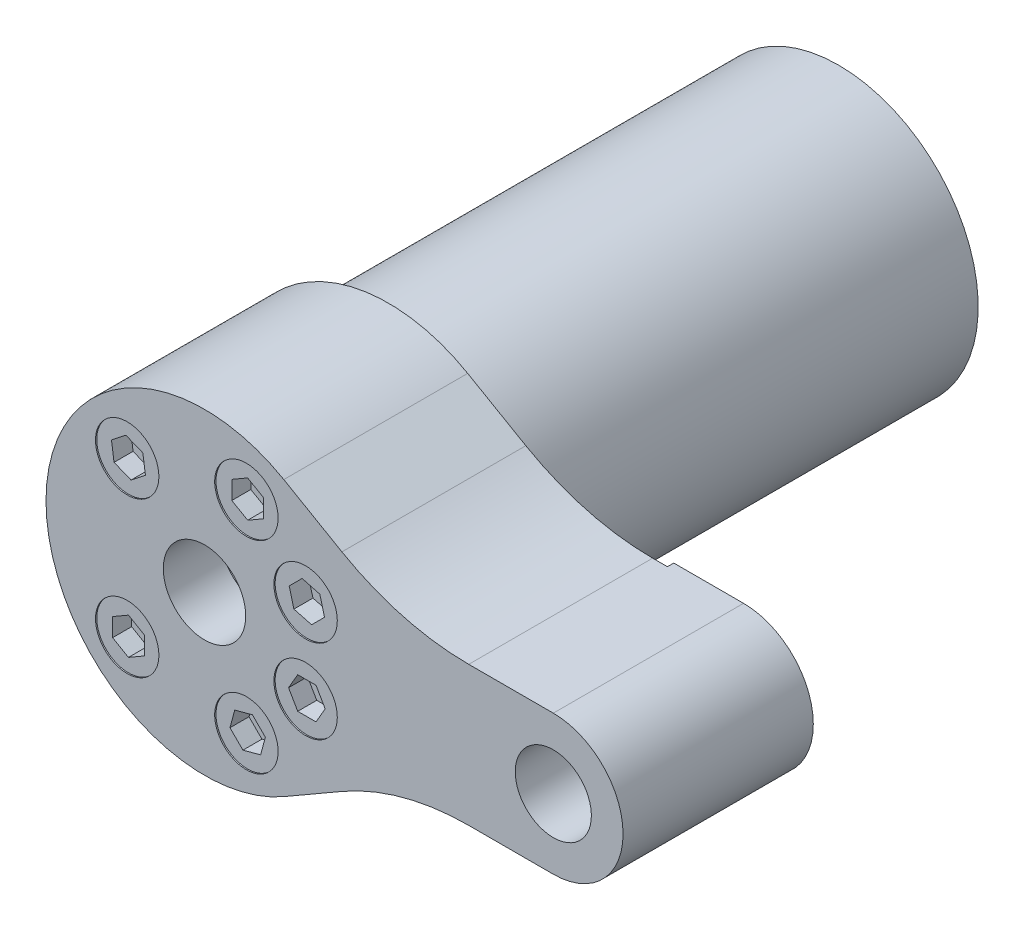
ISO-10303-21;
HEADER;
FILE_DESCRIPTION(('STEP AP214'),'2;1');
FILE_NAME('part.step','',(''),(''),'','','');
FILE_SCHEMA(('AUTOMOTIVE_DESIGN { 1 0 10303 214 1 1 1 1 }'));
ENDSEC;
DATA;
#1=APPLICATION_CONTEXT('core data for automotive mechanical design processes');
#2=APPLICATION_PROTOCOL_DEFINITION('international standard','automotive_design',2000,#1);
#3=PRODUCT_CONTEXT('',#1,'mechanical');
#4=PRODUCT('Part','Part','',(#3));
#5=PRODUCT_RELATED_PRODUCT_CATEGORY('part','',(#4));
#6=PRODUCT_DEFINITION_FORMATION('','',#4);
#7=PRODUCT_DEFINITION_CONTEXT('part definition',#1,'design');
#8=PRODUCT_DEFINITION('design','',#6,#7);
#9=PRODUCT_DEFINITION_SHAPE('','',#8);
#10=(LENGTH_UNIT() NAMED_UNIT(*) SI_UNIT(.MILLI.,.METRE.));
#11=(NAMED_UNIT(*) PLANE_ANGLE_UNIT() SI_UNIT($,.RADIAN.));
#12=(NAMED_UNIT(*) SI_UNIT($,.STERADIAN.) SOLID_ANGLE_UNIT());
#13=UNCERTAINTY_MEASURE_WITH_UNIT(LENGTH_MEASURE(1.E-05),#10,'distance_accuracy_value','');
#14=(GEOMETRIC_REPRESENTATION_CONTEXT(3) GLOBAL_UNCERTAINTY_ASSIGNED_CONTEXT((#13)) GLOBAL_UNIT_ASSIGNED_CONTEXT((#10,
#11,#12)) REPRESENTATION_CONTEXT('',''));
#15=CARTESIAN_POINT('',(0.,0.,0.));
#16=DIRECTION('',(0.,0.,1.));
#17=DIRECTION('',(1.,0.,0.));
#18=AXIS2_PLACEMENT_3D('',#15,#16,#17);
#19=CARTESIAN_POINT('',(-8.383405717,12.0096650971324,26.7999999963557));
#20=DIRECTION('',(0.,3.03448238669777E-10,1.));
#21=DIRECTION('',(-0.616660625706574,0.787229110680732,-2.38883287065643E-10));
#22=AXIS2_PLACEMENT_3D('',#19,#20,#21);
#23=PLANE('',#22);
#24=DIRECTION('',(-0.140429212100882,0.990090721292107,-3.00441285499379E-10));
#25=VECTOR('',#24,1.);
#26=CARTESIAN_POINT('',(-14.6728187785,11.8465189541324,26.7999999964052));
#27=LINE('',#26,#25);
#28=CARTESIAN_POINT('',(-14.4701266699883,10.4174460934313,26.7999999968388));
#29=VERTEX_POINT('',#28);
#30=CARTESIAN_POINT('',(-14.875510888,13.2755918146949,26.7999999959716));
#31=VERTEX_POINT('',#30);
#32=EDGE_CURVE('E302',#29,#31,#27,.T.);
#33=ORIENTED_EDGE('',*,*,#32,.F.);
#34=DIRECTION('',(0.927658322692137,-0.373430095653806,1.13316704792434E-10));
#35=VECTOR('',#34,1.);
#36=CARTESIAN_POINT('',(-13.1311672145,9.87844617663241,26.7999999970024));
#37=LINE('',#36,#35);
#38=CARTESIAN_POINT('',(-11.79220775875,9.33944626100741,26.7999999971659));
#39=VERTEX_POINT('',#38);
#40=EDGE_CURVE('E298',#29,#39,#37,.T.);
#41=ORIENTED_EDGE('',*,*,#40,.T.);
#42=DIRECTION('',(0.78722911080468,0.616660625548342,-1.87124580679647E-10));
#43=VECTOR('',#42,1.);
#44=CARTESIAN_POINT('',(-10.655940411,10.2295192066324,26.7999999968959));
#45=LINE('',#44,#43);
#46=CARTESIAN_POINT('',(-9.5196730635,11.1195921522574,26.7999999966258));
#47=VERTEX_POINT('',#46);
#48=EDGE_CURVE('E306',#39,#47,#45,.T.);
#49=ORIENTED_EDGE('',*,*,#48,.T.);
#50=DIRECTION('',(0.140429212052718,-0.990090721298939,3.00441285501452E-10));
#51=VECTOR('',#50,1.);
#52=CARTESIAN_POINT('',(-9.7223651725,12.5486650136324,26.7999999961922));
#53=LINE('',#52,#51);
#54=CARTESIAN_POINT('',(-9.92505728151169,13.9777378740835,26.7999999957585));
#55=VERTEX_POINT('',#54);
#56=EDGE_CURVE('E216',#55,#47,#53,.T.);
#57=ORIENTED_EDGE('',*,*,#56,.F.);
#58=DIRECTION('',(-0.92765832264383,0.373430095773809,-1.13316704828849E-10));
#59=VECTOR('',#58,1.);
#60=CARTESIAN_POINT('',(-11.264016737,14.5167377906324,26.7999999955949));
#61=LINE('',#60,#59);
#62=CARTESIAN_POINT('',(-12.60297619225,15.0557377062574,26.7999999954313));
#63=VERTEX_POINT('',#62);
#64=EDGE_CURVE('E212',#55,#63,#61,.T.);
#65=ORIENTED_EDGE('',*,*,#64,.T.);
#66=DIRECTION('',(-0.78722911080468,-0.616660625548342,1.87124580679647E-10));
#67=VECTOR('',#66,1.);
#68=CARTESIAN_POINT('',(-13.73924354,14.1656647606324,26.7999999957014));
#69=LINE('',#68,#67);
#70=EDGE_CURVE('E577',#63,#31,#69,.T.);
#71=ORIENTED_EDGE('',*,*,#70,.T.);
#72=EDGE_LOOP('',(#33,#41,#49,#57,#65,#71));
#73=FACE_BOUND('',#72,.T.);
#74=ADVANCED_FACE('F14',(#73),#23,.T.);
#75=CARTESIAN_POINT('',(12.127913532,6.32781471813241,26.7999999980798));
#76=DIRECTION('',(0.,3.03448238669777E-10,1.));
#77=DIRECTION('',(0.707106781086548,-0.707106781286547,2.14570307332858E-10));
#78=AXIS2_PLACEMENT_3D('',#75,#76,#77);
#79=PLANE('',#78);
#80=DIRECTION('',(0.258819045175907,-0.965925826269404,2.931084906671E-10));
#81=VECTOR('',#80,1.);
#82=CARTESIAN_POINT('',(18.3517365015,7.24833682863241,26.7999999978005));
#83=LINE('',#82,#81);
#84=CARTESIAN_POINT('',(17.9781633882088,8.64253066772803,26.7999999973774));
#85=VERTEX_POINT('',#84);
#86=CARTESIAN_POINT('',(18.7253096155,5.85414298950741,26.7999999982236));
#87=VERTEX_POINT('',#86);
#88=EDGE_CURVE('E319',#85,#87,#83,.T.);
#89=ORIENTED_EDGE('',*,*,#88,.F.);
#90=DIRECTION('',(-0.965925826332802,0.258819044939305,-7.8538183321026E-11));
#91=VECTOR('',#90,1.);
#92=CARTESIAN_POINT('',(16.583969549,9.01610378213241,26.7999999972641));
#93=LINE('',#92,#91);
#94=CARTESIAN_POINT('',(15.189775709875,9.38967689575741,26.7999999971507));
#95=VERTEX_POINT('',#94);
#96=EDGE_CURVE('E315',#85,#95,#93,.T.);
#97=ORIENTED_EDGE('',*,*,#96,.T.);
#98=DIRECTION('',(-0.707106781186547,-0.707106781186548,2.14570307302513E-10));
#99=VECTOR('',#98,1.);
#100=CARTESIAN_POINT('',(14.169154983,8.36905616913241,26.7999999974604));
#101=LINE('',#100,#99);
#102=CARTESIAN_POINT('',(13.148534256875,7.34843544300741,26.7999999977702));
#103=VERTEX_POINT('',#102);
#104=EDGE_CURVE('E336',#95,#103,#101,.T.);
#105=ORIENTED_EDGE('',*,*,#104,.T.);
#106=DIRECTION('',(-0.258819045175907,0.965925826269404,-2.931084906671E-10));
#107=VECTOR('',#106,1.);
#108=CARTESIAN_POINT('',(13.5221073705,5.95424160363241,26.7999999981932));
#109=LINE('',#108,#107);
#110=CARTESIAN_POINT('',(13.8956804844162,4.56004776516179,26.7999999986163));
#111=VERTEX_POINT('',#110);
#112=EDGE_CURVE('E332',#111,#103,#109,.T.);
#113=ORIENTED_EDGE('',*,*,#112,.F.);
#114=DIRECTION('',(0.9659258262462,-0.258819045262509,7.85381834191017E-11));
#115=VECTOR('',#114,1.);
#116=CARTESIAN_POINT('',(15.289874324,4.18647465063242,26.7999999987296));
#117=LINE('',#116,#115);
#118=CARTESIAN_POINT('',(16.68406816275,3.81290153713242,26.799999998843));
#119=VERTEX_POINT('',#118);
#120=EDGE_CURVE('E329',#111,#119,#117,.T.);
#121=ORIENTED_EDGE('',*,*,#120,.T.);
#122=DIRECTION('',(0.707106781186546,0.707106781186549,-2.14570307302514E-10));
#123=VECTOR('',#122,1.);
#124=CARTESIAN_POINT('',(17.704688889,4.83352226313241,26.7999999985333));
#125=LINE('',#124,#123);
#126=EDGE_CURVE('E1533',#119,#87,#125,.T.);
#127=ORIENTED_EDGE('',*,*,#126,.T.);
#128=EDGE_LOOP('',(#89,#97,#105,#113,#121,#127));
#129=FACE_BOUND('',#128,.T.);
#130=ADVANCED_FACE('F770',(#129),#79,.T.);
#131=CARTESIAN_POINT('',(4.101289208,13.0501705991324,26.79999999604));
#132=DIRECTION('',(0.,3.03448238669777E-10,1.));
#133=DIRECTION('',(1.,0.,0.));
#134=AXIS2_PLACEMENT_3D('',#131,#132,#133);
#135=PLANE('',#134);
#136=DIRECTION('',(0.866025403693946,-0.500000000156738,1.5172411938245E-10));
#137=VECTOR('',#136,1.);
#138=CARTESIAN_POINT('',(7.8512892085,18.1019854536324,26.799999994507));
#139=LINE('',#138,#137);
#140=CARTESIAN_POINT('',(6.60128920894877,18.823673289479,26.799999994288));
#141=VERTEX_POINT('',#140);
#142=CARTESIAN_POINT('',(9.101289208,17.3802976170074,26.799999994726));
#143=VERTEX_POINT('',#142);
#144=EDGE_CURVE('E349',#141,#143,#139,.T.);
#145=ORIENTED_EDGE('',*,*,#144,.F.);
#146=DIRECTION('',(-0.866025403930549,-0.49999999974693,1.51724119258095E-10));
#147=VECTOR('',#146,1.);
#148=CARTESIAN_POINT('',(5.351289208,18.1019854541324,26.799999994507));
#149=LINE('',#148,#147);
#150=CARTESIAN_POINT('',(4.101289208,17.3802976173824,26.799999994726));
#151=VERTEX_POINT('',#150);
#152=EDGE_CURVE('E345',#141,#151,#149,.T.);
#153=ORIENTED_EDGE('',*,*,#152,.T.);
#154=DIRECTION('',(0.,-1.,3.03448238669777E-10));
#155=VECTOR('',#154,1.);
#156=CARTESIAN_POINT('',(4.101289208,15.9369219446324,26.799999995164));
#157=LINE('',#156,#155);
#158=CARTESIAN_POINT('',(4.101289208,14.4935462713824,26.799999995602));
#159=VERTEX_POINT('',#158);
#160=EDGE_CURVE('E366',#151,#159,#157,.T.);
#161=ORIENTED_EDGE('',*,*,#160,.T.);
#162=DIRECTION('',(-0.866025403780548,0.500000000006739,-1.51724119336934E-10));
#163=VECTOR('',#162,1.);
#164=CARTESIAN_POINT('',(5.351289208,13.7718584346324,26.7999999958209));
#165=LINE('',#164,#163);
#166=CARTESIAN_POINT('',(6.60128920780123,13.0501705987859,26.79999999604));
#167=VERTEX_POINT('',#166);
#168=EDGE_CURVE('E362',#167,#159,#165,.T.);
#169=ORIENTED_EDGE('',*,*,#168,.F.);
#170=DIRECTION('',(0.866025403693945,0.500000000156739,-1.51724119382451E-10));
#171=VECTOR('',#170,1.);
#172=CARTESIAN_POINT('',(7.8512892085,13.7718584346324,26.7999999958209));
#173=LINE('',#172,#171);
#174=CARTESIAN_POINT('',(9.101289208,14.4935462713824,26.799999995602));
#175=VERTEX_POINT('',#174);
#176=EDGE_CURVE('E359',#167,#175,#173,.T.);
#177=ORIENTED_EDGE('',*,*,#176,.T.);
#178=DIRECTION('',(0.,1.,-3.03448238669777E-10));
#179=VECTOR('',#178,1.);
#180=CARTESIAN_POINT('',(9.101289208,15.9369219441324,26.799999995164));
#181=LINE('',#180,#179);
#182=EDGE_CURVE('E1522',#175,#143,#181,.T.);
#183=ORIENTED_EDGE('',*,*,#182,.T.);
#184=EDGE_LOOP('',(#145,#153,#161,#169,#177,#183));
#185=FACE_BOUND('',#184,.T.);
#186=ADVANCED_FACE('F773',(#185),#135,.T.);
#187=CARTESIAN_POINT('',(-14.697591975,-15.0843433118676,26.8000000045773));
#188=DIRECTION('',(0.,3.03448238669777E-10,1.));
#189=DIRECTION('',(1.,0.,0.));
#190=AXIS2_PLACEMENT_3D('',#187,#188,#189);
#191=PLANE('',#190);
#192=DIRECTION('',(0.866025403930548,-0.49999999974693,1.51724119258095E-10));
#193=VECTOR('',#192,1.);
#194=CARTESIAN_POINT('',(-10.947591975,-10.0325284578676,26.8000000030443));
#195=LINE('',#194,#193);
#196=CARTESIAN_POINT('',(-12.1975919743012,-9.31084062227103,26.8000000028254));
#197=VERTEX_POINT('',#196);
#198=CARTESIAN_POINT('',(-9.697591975,-10.7542162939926,26.8000000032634));
#199=VERTEX_POINT('',#198);
#200=EDGE_CURVE('E379',#197,#199,#195,.T.);
#201=ORIENTED_EDGE('',*,*,#200,.F.);
#202=DIRECTION('',(-0.866025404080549,-0.499999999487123,1.51724119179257E-10));
#203=VECTOR('',#202,1.);
#204=CARTESIAN_POINT('',(-13.447591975,-10.0325284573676,26.8000000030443));
#205=LINE('',#204,#203);
#206=CARTESIAN_POINT('',(-14.697591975,-10.7542162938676,26.8000000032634));
#207=VERTEX_POINT('',#206);
#208=EDGE_CURVE('E375',#197,#207,#205,.T.);
#209=ORIENTED_EDGE('',*,*,#208,.T.);
#210=DIRECTION('',(0.,-1.,3.03448238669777E-10));
#211=VECTOR('',#210,1.);
#212=CARTESIAN_POINT('',(-14.697591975,-12.1975919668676,26.8000000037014));
#213=LINE('',#212,#211);
#214=CARTESIAN_POINT('',(-14.697591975,-13.6409676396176,26.8000000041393));
#215=VERTEX_POINT('',#214);
#216=EDGE_CURVE('E396',#207,#215,#213,.T.);
#217=ORIENTED_EDGE('',*,*,#216,.T.);
#218=DIRECTION('',(-0.866025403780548,0.500000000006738,-1.51724119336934E-10));
#219=VECTOR('',#218,1.);
#220=CARTESIAN_POINT('',(-13.447591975,-14.3626554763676,26.8000000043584));
#221=LINE('',#220,#219);
#222=CARTESIAN_POINT('',(-12.1975919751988,-15.0843433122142,26.8000000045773));
#223=VERTEX_POINT('',#222);
#224=EDGE_CURVE('E392',#223,#215,#221,.T.);
#225=ORIENTED_EDGE('',*,*,#224,.F.);
#226=DIRECTION('',(0.866025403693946,0.500000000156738,-1.5172411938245E-10));
#227=VECTOR('',#226,1.);
#228=CARTESIAN_POINT('',(-10.9475919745,-14.3626554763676,26.8000000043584));
#229=LINE('',#228,#227);
#230=CARTESIAN_POINT('',(-9.697591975,-13.6409676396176,26.8000000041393));
#231=VERTEX_POINT('',#230);
#232=EDGE_CURVE('E389',#223,#231,#229,.T.);
#233=ORIENTED_EDGE('',*,*,#232,.T.);
#234=DIRECTION('',(0.,1.,-3.03448238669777E-10));
#235=VECTOR('',#234,1.);
#236=CARTESIAN_POINT('',(-9.697591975,-12.1975919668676,26.8000000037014));
#237=LINE('',#236,#235);
#238=EDGE_CURVE('E1511',#231,#199,#237,.T.);
#239=ORIENTED_EDGE('',*,*,#238,.T.);
#240=EDGE_LOOP('',(#201,#209,#217,#225,#233,#239));
#241=FACE_BOUND('',#240,.T.);
#242=ADVANCED_FACE('F777',(#241),#191,.T.);
#243=CARTESIAN_POINT('',(13.050170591,-4.10128919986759,26.8000000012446));
#244=DIRECTION('',(0.,3.03448238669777E-10,1.));
#245=DIRECTION('',(0.,-1.,3.03448238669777E-10));
#246=AXIS2_PLACEMENT_3D('',#243,#244,#245);
#247=PLANE('',#246);
#248=DIRECTION('',(-0.500000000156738,-0.866025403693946,2.6279388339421E-10));
#249=VECTOR('',#248,1.);
#250=CARTESIAN_POINT('',(18.1019854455,-7.85128920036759,26.8000000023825));
#251=LINE('',#250,#249);
#252=CARTESIAN_POINT('',(18.8236732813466,-6.60128920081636,26.8000000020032));
#253=VERTEX_POINT('',#252);
#254=CARTESIAN_POINT('',(17.380297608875,-9.10128919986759,26.8000000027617));
#255=VERTEX_POINT('',#254);
#256=EDGE_CURVE('E409',#253,#255,#251,.T.);
#257=ORIENTED_EDGE('',*,*,#256,.F.);
#258=DIRECTION('',(-0.49999999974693,0.866025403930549,-2.62793883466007E-10));
#259=VECTOR('',#258,1.);
#260=CARTESIAN_POINT('',(18.101985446,-5.35128919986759,26.8000000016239));
#261=LINE('',#260,#259);
#262=CARTESIAN_POINT('',(17.38029760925,-4.10128919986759,26.8000000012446));
#263=VERTEX_POINT('',#262);
#264=EDGE_CURVE('E405',#253,#263,#261,.T.);
#265=ORIENTED_EDGE('',*,*,#264,.T.);
#266=DIRECTION('',(-1.,0.,0.));
#267=VECTOR('',#266,1.);
#268=CARTESIAN_POINT('',(15.9369219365,-4.10128919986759,26.8000000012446));
#269=LINE('',#268,#267);
#270=CARTESIAN_POINT('',(14.49354626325,-4.10128919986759,26.8000000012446));
#271=VERTEX_POINT('',#270);
#272=EDGE_CURVE('E426',#263,#271,#269,.T.);
#273=ORIENTED_EDGE('',*,*,#272,.T.);
#274=DIRECTION('',(0.500000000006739,0.866025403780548,-2.6279388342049E-10));
#275=VECTOR('',#274,1.);
#276=CARTESIAN_POINT('',(13.7718584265,-5.35128919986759,26.8000000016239));
#277=LINE('',#276,#275);
#278=CARTESIAN_POINT('',(13.0501705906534,-6.60128919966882,26.8000000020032));
#279=VERTEX_POINT('',#278);
#280=EDGE_CURVE('E422',#279,#271,#277,.T.);
#281=ORIENTED_EDGE('',*,*,#280,.F.);
#282=DIRECTION('',(0.500000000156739,-0.866025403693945,2.6279388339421E-10));
#283=VECTOR('',#282,1.);
#284=CARTESIAN_POINT('',(13.7718584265,-7.85128920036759,26.8000000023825));
#285=LINE('',#284,#283);
#286=CARTESIAN_POINT('',(14.49354626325,-9.10128919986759,26.8000000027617));
#287=VERTEX_POINT('',#286);
#288=EDGE_CURVE('E419',#279,#287,#285,.T.);
#289=ORIENTED_EDGE('',*,*,#288,.T.);
#290=DIRECTION('',(1.,0.,0.));
#291=VECTOR('',#290,1.);
#292=CARTESIAN_POINT('',(15.936921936,-9.10128919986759,26.8000000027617));
#293=LINE('',#292,#291);
#294=EDGE_CURVE('E1500',#287,#255,#293,.T.);
#295=ORIENTED_EDGE('',*,*,#294,.T.);
#296=EDGE_LOOP('',(#257,#265,#273,#281,#289,#295));
#297=FACE_BOUND('',#296,.T.);
#298=ADVANCED_FACE('F781',(#297),#247,.T.);
#299=CARTESIAN_POINT('',(6.32781471,-12.1279135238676,26.8000000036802));
#300=DIRECTION('',(0.,3.03448238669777E-10,1.));
#301=DIRECTION('',(-0.707106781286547,-0.707106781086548,2.14570307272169E-10));
#302=AXIS2_PLACEMENT_3D('',#299,#300,#301);
#303=PLANE('',#302);
#304=DIRECTION('',(-0.965925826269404,-0.258819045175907,7.85381833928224E-11));
#305=VECTOR('',#304,1.);
#306=CARTESIAN_POINT('',(7.2483368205,-18.3517364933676,26.8000000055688));
#307=LINE('',#306,#305);
#308=CARTESIAN_POINT('',(8.64253065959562,-17.9781633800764,26.8000000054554));
#309=VERTEX_POINT('',#308);
#310=CARTESIAN_POINT('',(5.854142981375,-18.7253096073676,26.8000000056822));
#311=VERTEX_POINT('',#310);
#312=EDGE_CURVE('E287',#309,#311,#307,.T.);
#313=ORIENTED_EDGE('',*,*,#312,.F.);
#314=DIRECTION('',(0.258819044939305,0.965925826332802,-2.93108490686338E-10));
#315=VECTOR('',#314,1.);
#316=CARTESIAN_POINT('',(9.016103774,-16.5839695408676,26.8000000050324));
#317=LINE('',#316,#315);
#318=CARTESIAN_POINT('',(9.389676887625,-15.1897757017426,26.8000000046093));
#319=VERTEX_POINT('',#318);
#320=EDGE_CURVE('E435',#309,#319,#317,.T.);
#321=ORIENTED_EDGE('',*,*,#320,.T.);
#322=DIRECTION('',(-0.707106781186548,0.707106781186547,-2.14570307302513E-10));
#323=VECTOR('',#322,1.);
#324=CARTESIAN_POINT('',(8.369056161,-14.1691549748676,26.8000000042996));
#325=LINE('',#324,#323);
#326=CARTESIAN_POINT('',(7.348435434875,-13.1485342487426,26.8000000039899));
#327=VERTEX_POINT('',#326);
#328=EDGE_CURVE('E454',#319,#327,#325,.T.);
#329=ORIENTED_EDGE('',*,*,#328,.T.);
#330=DIRECTION('',(0.965925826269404,0.258819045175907,-7.85381833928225E-11));
#331=VECTOR('',#330,1.);
#332=CARTESIAN_POINT('',(5.9542415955,-13.5221073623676,26.8000000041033));
#333=LINE('',#332,#331);
#334=CARTESIAN_POINT('',(4.56004775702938,-13.8956804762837,26.8000000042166));
#335=VERTEX_POINT('',#334);
#336=EDGE_CURVE('E451',#335,#327,#333,.T.);
#337=ORIENTED_EDGE('',*,*,#336,.F.);
#338=DIRECTION('',(-0.258819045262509,-0.9659258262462,2.93108490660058E-10));
#339=VECTOR('',#338,1.);
#340=CARTESIAN_POINT('',(4.1864746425,-15.2898743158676,26.8000000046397));
#341=LINE('',#340,#339);
#342=CARTESIAN_POINT('',(3.812901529,-16.6840681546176,26.8000000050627));
#343=VERTEX_POINT('',#342);
#344=EDGE_CURVE('E448',#335,#343,#341,.T.);
#345=ORIENTED_EDGE('',*,*,#344,.T.);
#346=DIRECTION('',(0.707106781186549,-0.707106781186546,2.14570307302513E-10));
#347=VECTOR('',#346,1.);
#348=CARTESIAN_POINT('',(4.833522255,-17.7046888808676,26.8000000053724));
#349=LINE('',#348,#347);
#350=EDGE_CURVE('E1489',#343,#311,#349,.T.);
#351=ORIENTED_EDGE('',*,*,#350,.T.);
#352=EDGE_LOOP('',(#313,#321,#329,#337,#345,#351));
#353=FACE_BOUND('',#352,.T.);
#354=ADVANCED_FACE('F785',(#353),#303,.T.);
#355=CARTESIAN_POINT('',(0.,-2.12413767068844E-08,-70.));
#356=DIRECTION('',(0.,3.03448238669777E-10,1.));
#357=DIRECTION('',(0.,1.,-3.03448238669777E-10));
#358=AXIS2_PLACEMENT_3D('',#355,#356,#357);
#359=CYLINDRICAL_SURFACE('',#358,22.);
#360=CARTESIAN_POINT('',(0.,-2.12413767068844E-08,-70.));
#361=DIRECTION('',(0.,3.03448238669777E-10,1.));
#362=DIRECTION('',(0.,1.,-3.03448238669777E-10));
#363=AXIS2_PLACEMENT_3D('',#360,#361,#362);
#364=CIRCLE('',#363,22.);
#365=CARTESIAN_POINT('',(0.,21.9999999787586,-70.0000000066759));
#366=VERTEX_POINT('',#365);
#367=EDGE_CURVE('E18',#366,#366,#364,.T.);
#368=ORIENTED_EDGE('',*,*,#367,.T.);
#369=EDGE_LOOP('',(#368));
#370=FACE_BOUND('',#369,.T.);
#371=CARTESIAN_POINT('',(0.,3.03448238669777E-10,1.));
#372=DIRECTION('',(0.,3.03448238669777E-10,1.));
#373=DIRECTION('',(0.,1.,-3.03448238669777E-10));
#374=AXIS2_PLACEMENT_3D('',#371,#372,#373);
#375=CIRCLE('',#374,22.);
#376=CARTESIAN_POINT('',(0.,22.0000000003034,0.999999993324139));
#377=VERTEX_POINT('',#376);
#378=EDGE_CURVE('E229',#377,#377,#375,.F.);
#379=ORIENTED_EDGE('',*,*,#378,.T.);
#380=EDGE_LOOP('',(#379));
#381=FACE_BOUND('',#380,.T.);
#382=ADVANCED_FACE('F789',(#370,#381),#359,.T.);
#383=CARTESIAN_POINT('',(-12.602976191,15.0557377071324,26.7999999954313));
#384=DIRECTION('',(-0.616660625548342,0.78722911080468,-2.38883287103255E-10));
#385=DIRECTION('',(-0.78722911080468,-0.616660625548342,1.87124580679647E-10));
#386=AXIS2_PLACEMENT_3D('',#383,#384,#385);
#387=PLANE('',#386);
#388=ORIENTED_EDGE('',*,*,#70,.F.);
#389=DIRECTION('',(0.,3.03448238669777E-10,1.));
#390=VECTOR('',#389,1.);
#391=CARTESIAN_POINT('',(-12.602976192,15.0557377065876,28.2999999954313));
#392=LINE('',#391,#390);
#393=CARTESIAN_POINT('',(-12.6029761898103,15.055737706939,29.7999999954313));
#394=VERTEX_POINT('',#393);
#395=EDGE_CURVE('E217',#63,#394,#392,.T.);
#396=ORIENTED_EDGE('',*,*,#395,.T.);
#397=DIRECTION('',(0.787229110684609,0.616660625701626,-1.87124580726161E-10));
#398=VECTOR('',#397,1.);
#399=CARTESIAN_POINT('',(-13.7392435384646,14.1656647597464,29.7999999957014));
#400=LINE('',#399,#398);
#401=CARTESIAN_POINT('',(-14.8755108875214,13.2755918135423,29.7999999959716));
#402=VERTEX_POINT('',#401);
#403=EDGE_CURVE('E193',#402,#394,#400,.T.);
#404=ORIENTED_EDGE('',*,*,#403,.F.);
#405=DIRECTION('',(0.,3.03448238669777E-10,1.));
#406=VECTOR('',#405,1.);
#407=CARTESIAN_POINT('',(-14.875510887,13.2755918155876,28.2999999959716));
#408=LINE('',#407,#406);
#409=EDGE_CURVE('E297',#31,#402,#408,.T.);
#410=ORIENTED_EDGE('',*,*,#409,.F.);
#411=EDGE_LOOP('',(#388,#396,#404,#410));
#412=FACE_BOUND('',#411,.T.);
#413=ADVANCED_FACE('F574',(#412),#387,.F.);
#414=CARTESIAN_POINT('',(-9.925057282,13.9777378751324,26.7999999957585));
#415=DIRECTION('',(0.373430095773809,0.92765832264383,-2.8149628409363E-10));
#416=DIRECTION('',(-0.92765832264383,0.373430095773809,-1.13316704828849E-10));
#417=AXIS2_PLACEMENT_3D('',#414,#415,#416);
#418=PLANE('',#417);
#419=ORIENTED_EDGE('',*,*,#64,.F.);
#420=DIRECTION('',(0.,-3.03448238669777E-10,-1.));
#421=VECTOR('',#420,1.);
#422=CARTESIAN_POINT('',(-9.925057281,13.9777378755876,28.2999999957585));
#423=LINE('',#422,#421);
#424=CARTESIAN_POINT('',(-9.92505728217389,13.9777378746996,29.7999999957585));
#425=VERTEX_POINT('',#424);
#426=EDGE_CURVE('E208',#425,#55,#423,.T.);
#427=ORIENTED_EDGE('',*,*,#426,.F.);
#428=DIRECTION('',(0.927658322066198,-0.373430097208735,1.13316705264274E-10));
#429=VECTOR('',#428,1.);
#430=CARTESIAN_POINT('',(-12.6029761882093,15.0557377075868,29.7999999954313));
#431=LINE('',#430,#429);
#432=EDGE_CURVE('E196',#394,#425,#431,.T.);
#433=ORIENTED_EDGE('',*,*,#432,.F.);
#434=ORIENTED_EDGE('',*,*,#395,.F.);
#435=EDGE_LOOP('',(#419,#427,#433,#434));
#436=FACE_BOUND('',#435,.T.);
#437=ADVANCED_FACE('F209',(#436),#418,.F.);
#438=CARTESIAN_POINT('',(-9.925057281,13.9777378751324,26.7999999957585));
#439=DIRECTION('',(-0.990090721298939,-0.140429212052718,4.2612997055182E-11));
#440=DIRECTION('',(0.140429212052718,-0.990090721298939,3.00441285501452E-10));
#441=AXIS2_PLACEMENT_3D('',#438,#439,#440);
#442=PLANE('',#441);
#443=ORIENTED_EDGE('',*,*,#426,.T.);
#444=ORIENTED_EDGE('',*,*,#56,.T.);
#445=DIRECTION('',(0.,3.03448238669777E-10,1.));
#446=VECTOR('',#445,1.);
#447=CARTESIAN_POINT('',(-9.519673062,11.1195921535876,28.2999999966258));
#448=LINE('',#447,#446);
#449=CARTESIAN_POINT('',(-9.51967306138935,11.1195921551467,29.7999999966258));
#450=VERTEX_POINT('',#449);
#451=EDGE_CURVE('E221',#47,#450,#448,.T.);
#452=ORIENTED_EDGE('',*,*,#451,.T.);
#453=DIRECTION('',(0.140429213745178,-0.990090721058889,3.00441285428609E-10));
#454=VECTOR('',#453,1.);
#455=CARTESIAN_POINT('',(-9.92505728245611,13.9777378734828,29.7999999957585));
#456=LINE('',#455,#454);
#457=EDGE_CURVE('E201',#425,#450,#456,.T.);
#458=ORIENTED_EDGE('',*,*,#457,.F.);
#459=EDGE_LOOP('',(#443,#444,#452,#458));
#460=FACE_BOUND('',#459,.T.);
#461=ADVANCED_FACE('F219',(#460),#442,.T.);
#462=CARTESIAN_POINT('',(-11.79220776,9.33944626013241,26.7999999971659));
#463=DIRECTION('',(0.616660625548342,-0.787229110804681,2.38883287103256E-10));
#464=DIRECTION('',(0.787229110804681,0.616660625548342,-1.87124580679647E-10));
#465=AXIS2_PLACEMENT_3D('',#462,#463,#464);
#466=PLANE('',#465);
#467=ORIENTED_EDGE('',*,*,#48,.F.);
#468=DIRECTION('',(0.,3.03448238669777E-10,1.));
#469=VECTOR('',#468,1.);
#470=CARTESIAN_POINT('',(-11.792207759,9.33944626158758,28.299999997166));
#471=LINE('',#470,#469);
#472=CARTESIAN_POINT('',(-11.7922077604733,9.33944626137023,29.7999999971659));
#473=VERTEX_POINT('',#472);
#474=EDGE_CURVE('E294',#39,#473,#471,.T.);
#475=ORIENTED_EDGE('',*,*,#474,.T.);
#476=DIRECTION('',(-0.787229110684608,-0.616660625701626,1.87124580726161E-10));
#477=VECTOR('',#476,1.);
#478=CARTESIAN_POINT('',(-10.6559404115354,10.2295192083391,29.7999999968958));
#479=LINE('',#478,#477);
#480=EDGE_CURVE('E223',#450,#473,#479,.T.);
#481=ORIENTED_EDGE('',*,*,#480,.F.);
#482=ORIENTED_EDGE('',*,*,#451,.F.);
#483=EDGE_LOOP('',(#467,#475,#481,#482));
#484=FACE_BOUND('',#483,.T.);
#485=ADVANCED_FACE('F797',(#484),#466,.F.);
#486=CARTESIAN_POINT('',(-14.47012667,10.4174460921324,26.7999999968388));
#487=DIRECTION('',(-0.373430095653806,-0.927658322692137,2.81496284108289E-10));
#488=DIRECTION('',(0.927658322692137,-0.373430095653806,1.13316704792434E-10));
#489=AXIS2_PLACEMENT_3D('',#486,#487,#488);
#490=PLANE('',#489);
#491=ORIENTED_EDGE('',*,*,#474,.F.);
#492=ORIENTED_EDGE('',*,*,#40,.F.);
#493=DIRECTION('',(0.,-3.03448238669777E-10,-1.));
#494=VECTOR('',#493,1.);
#495=CARTESIAN_POINT('',(-14.47012667,10.4174460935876,28.2999999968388));
#496=LINE('',#495,#494);
#497=CARTESIAN_POINT('',(-14.4701266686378,10.4174460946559,29.7999999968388));
#498=VERTEX_POINT('',#497);
#499=EDGE_CURVE('E299',#498,#29,#496,.T.);
#500=ORIENTED_EDGE('',*,*,#499,.F.);
#501=DIRECTION('',(-0.927658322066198,0.373430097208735,-1.13316705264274E-10));
#502=VECTOR('',#501,1.);
#503=CARTESIAN_POINT('',(-11.7922077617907,9.33944626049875,29.7999999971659));
#504=LINE('',#503,#502);
#505=EDGE_CURVE('E225',#473,#498,#504,.T.);
#506=ORIENTED_EDGE('',*,*,#505,.F.);
#507=EDGE_LOOP('',(#491,#492,#500,#506));
#508=FACE_BOUND('',#507,.T.);
#509=ADVANCED_FACE('F563',(#508),#490,.F.);
#510=CARTESIAN_POINT('',(-14.47012667,10.4174460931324,26.7999999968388));
#511=DIRECTION('',(0.990090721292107,0.140429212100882,-4.26129970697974E-11));
#512=DIRECTION('',(-0.140429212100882,0.990090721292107,-3.00441285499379E-10));
#513=AXIS2_PLACEMENT_3D('',#510,#511,#512);
#514=PLANE('',#513);
#515=ORIENTED_EDGE('',*,*,#499,.T.);
#516=ORIENTED_EDGE('',*,*,#32,.T.);
#517=ORIENTED_EDGE('',*,*,#409,.T.);
#518=DIRECTION('',(-0.140429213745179,0.990090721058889,-3.00441285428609E-10));
#519=VECTOR('',#518,1.);
#520=CARTESIAN_POINT('',(-14.4701266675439,10.4174460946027,29.7999999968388));
#521=LINE('',#520,#519);
#522=EDGE_CURVE('E324',#498,#402,#521,.T.);
#523=ORIENTED_EDGE('',*,*,#522,.F.);
#524=EDGE_LOOP('',(#515,#516,#517,#523));
#525=FACE_BOUND('',#524,.T.);
#526=ADVANCED_FACE('F569',(#525),#514,.T.);
#527=CARTESIAN_POINT('',(16.684068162,3.81290153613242,26.799999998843));
#528=DIRECTION('',(0.707106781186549,-0.707106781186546,2.14570307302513E-10));
#529=DIRECTION('',(0.707106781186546,0.707106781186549,-2.14570307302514E-10));
#530=AXIS2_PLACEMENT_3D('',#527,#528,#529);
#531=PLANE('',#530);
#532=ORIENTED_EDGE('',*,*,#126,.F.);
#533=DIRECTION('',(0.,3.03448238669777E-10,1.));
#534=VECTOR('',#533,1.);
#535=CARTESIAN_POINT('',(16.684068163,3.81290153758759,28.299999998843));
#536=LINE('',#535,#534);
#537=CARTESIAN_POINT('',(16.6840681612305,3.81290153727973,29.799999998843));
#538=VERTEX_POINT('',#537);
#539=EDGE_CURVE('E325',#119,#538,#536,.T.);
#540=ORIENTED_EDGE('',*,*,#539,.T.);
#541=DIRECTION('',(-0.707106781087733,-0.707106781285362,2.14570307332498E-10));
#542=VECTOR('',#541,1.);
#543=CARTESIAN_POINT('',(17.7046888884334,4.83352226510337,29.7999999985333));
#544=LINE('',#543,#542);
#545=CARTESIAN_POINT('',(18.7253096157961,5.85414299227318,29.7999999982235));
#546=VERTEX_POINT('',#545);
#547=EDGE_CURVE('E321',#546,#538,#544,.T.);
#548=ORIENTED_EDGE('',*,*,#547,.F.);
#549=DIRECTION('',(0.,3.03448238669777E-10,1.));
#550=VECTOR('',#549,1.);
#551=CARTESIAN_POINT('',(18.725309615,5.85414298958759,28.2999999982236));
#552=LINE('',#551,#550);
#553=EDGE_CURVE('E314',#87,#546,#552,.T.);
#554=ORIENTED_EDGE('',*,*,#553,.F.);
#555=EDGE_LOOP('',(#532,#540,#548,#554));
#556=FACE_BOUND('',#555,.T.);
#557=ADVANCED_FACE('F805',(#556),#531,.F.);
#558=CARTESIAN_POINT('',(13.895680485,4.56004776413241,26.7999999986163));
#559=DIRECTION('',(-0.258819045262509,-0.965925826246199,2.93108490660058E-10));
#560=DIRECTION('',(0.965925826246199,-0.258819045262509,7.85381834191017E-11));
#561=AXIS2_PLACEMENT_3D('',#558,#559,#560);
#562=PLANE('',#561);
#563=ORIENTED_EDGE('',*,*,#120,.F.);
#564=DIRECTION('',(0.,-3.03448238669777E-10,-1.));
#565=VECTOR('',#564,1.);
#566=CARTESIAN_POINT('',(13.895680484,4.56004776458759,28.2999999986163));
#567=LINE('',#566,#565);
#568=CARTESIAN_POINT('',(13.8956804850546,4.56004776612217,29.7999999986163));
#569=VERTEX_POINT('',#568);
#570=EDGE_CURVE('E328',#569,#111,#567,.T.);
#571=ORIENTED_EDGE('',*,*,#570,.F.);
#572=DIRECTION('',(-0.965925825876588,0.258819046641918,-7.85381838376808E-11));
#573=VECTOR('',#572,1.);
#574=CARTESIAN_POINT('',(16.6840681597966,3.81290153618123,29.799999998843));
#575=LINE('',#574,#573);
#576=EDGE_CURVE('E323',#538,#569,#575,.T.);
#577=ORIENTED_EDGE('',*,*,#576,.F.);
#578=ORIENTED_EDGE('',*,*,#539,.F.);
#579=EDGE_LOOP('',(#563,#571,#577,#578));
#580=FACE_BOUND('',#579,.T.);
#581=ADVANCED_FACE('F808',(#580),#562,.F.);
#582=CARTESIAN_POINT('',(13.895680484,4.56004776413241,26.7999999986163));
#583=DIRECTION('',(0.965925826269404,0.258819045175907,-7.85381833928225E-11));
#584=DIRECTION('',(-0.258819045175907,0.965925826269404,-2.931084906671E-10));
#585=AXIS2_PLACEMENT_3D('',#582,#583,#584);
#586=PLANE('',#585);
#587=ORIENTED_EDGE('',*,*,#570,.T.);
#588=ORIENTED_EDGE('',*,*,#112,.T.);
#589=DIRECTION('',(0.,3.03448238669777E-10,1.));
#590=VECTOR('',#589,1.);
#591=CARTESIAN_POINT('',(13.148534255,7.34843544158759,28.2999999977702));
#592=LINE('',#591,#590);
#593=CARTESIAN_POINT('',(13.1485342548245,7.34843544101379,29.7999999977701));
#594=VERTEX_POINT('',#593);
#595=EDGE_CURVE('E333',#103,#594,#592,.T.);
#596=ORIENTED_EDGE('',*,*,#595,.T.);
#597=DIRECTION('',(-0.258819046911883,0.965925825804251,-2.9310849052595E-10));
#598=VECTOR('',#597,1.);
#599=CARTESIAN_POINT('',(13.8956804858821,4.56004776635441,29.7999999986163));
#600=LINE('',#599,#598);
#601=EDGE_CURVE('E310',#569,#594,#600,.T.);
#602=ORIENTED_EDGE('',*,*,#601,.F.);
#603=EDGE_LOOP('',(#587,#588,#596,#602));
#604=FACE_BOUND('',#603,.T.);
#605=ADVANCED_FACE('F812',(#604),#586,.T.);
#606=CARTESIAN_POINT('',(15.189775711,9.38967689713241,26.7999999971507));
#607=DIRECTION('',(-0.707106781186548,0.707106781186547,-2.14570307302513E-10));
#608=DIRECTION('',(-0.707106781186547,-0.707106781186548,2.14570307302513E-10));
#609=AXIS2_PLACEMENT_3D('',#606,#607,#608);
#610=PLANE('',#609);
#611=ORIENTED_EDGE('',*,*,#104,.F.);
#612=DIRECTION('',(0.,3.03448238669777E-10,1.));
#613=VECTOR('',#612,1.);
#614=CARTESIAN_POINT('',(15.18977571,9.38967689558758,28.2999999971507));
#615=LINE('',#614,#613);
#616=CARTESIAN_POINT('',(15.1897757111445,9.38967689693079,29.7999999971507));
#617=VERTEX_POINT('',#616);
#618=EDGE_CURVE('E311',#95,#617,#615,.T.);
#619=ORIENTED_EDGE('',*,*,#618,.T.);
#620=DIRECTION('',(0.707106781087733,0.707106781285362,-2.14570307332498E-10));
#621=VECTOR('',#620,1.);
#622=CARTESIAN_POINT('',(14.1691549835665,8.36905616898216,29.7999999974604));
#623=LINE('',#622,#621);
#624=EDGE_CURVE('E307',#594,#617,#623,.T.);
#625=ORIENTED_EDGE('',*,*,#624,.F.);
#626=ORIENTED_EDGE('',*,*,#595,.F.);
#627=EDGE_LOOP('',(#611,#619,#625,#626));
#628=FACE_BOUND('',#627,.T.);
#629=ADVANCED_FACE('F816',(#628),#610,.F.);
#630=CARTESIAN_POINT('',(17.978163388,8.64253066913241,26.7999999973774));
#631=DIRECTION('',(0.258819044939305,0.965925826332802,-2.93108490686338E-10));
#632=DIRECTION('',(-0.965925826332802,0.258819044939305,-7.8538183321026E-11));
#633=AXIS2_PLACEMENT_3D('',#630,#631,#632);
#634=PLANE('',#633);
#635=ORIENTED_EDGE('',*,*,#618,.F.);
#636=ORIENTED_EDGE('',*,*,#96,.F.);
#637=DIRECTION('',(0.,-3.03448238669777E-10,-1.));
#638=VECTOR('',#637,1.);
#639=CARTESIAN_POINT('',(17.978163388,8.64253066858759,28.2999999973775));
#640=LINE('',#639,#638);
#641=CARTESIAN_POINT('',(17.9781633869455,8.64253066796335,29.7999999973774));
#642=VERTEX_POINT('',#641);
#643=EDGE_CURVE('E316',#642,#85,#640,.T.);
#644=ORIENTED_EDGE('',*,*,#643,.F.);
#645=DIRECTION('',(0.965925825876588,-0.258819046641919,7.85381838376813E-11));
#646=VECTOR('',#645,1.);
#647=CARTESIAN_POINT('',(15.1897757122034,9.38967689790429,29.7999999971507));
#648=LINE('',#647,#646);
#649=EDGE_CURVE('E309',#617,#642,#648,.T.);
#650=ORIENTED_EDGE('',*,*,#649,.F.);
#651=EDGE_LOOP('',(#635,#636,#644,#650));
#652=FACE_BOUND('',#651,.T.);
#653=ADVANCED_FACE('F820',(#652),#634,.F.);
#654=CARTESIAN_POINT('',(17.978163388,8.64253066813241,26.7999999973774));
#655=DIRECTION('',(-0.965925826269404,-0.258819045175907,7.85381833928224E-11));
#656=DIRECTION('',(0.258819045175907,-0.965925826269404,2.931084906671E-10));
#657=AXIS2_PLACEMENT_3D('',#654,#655,#656);
#658=PLANE('',#657);
#659=ORIENTED_EDGE('',*,*,#643,.T.);
#660=ORIENTED_EDGE('',*,*,#88,.T.);
#661=ORIENTED_EDGE('',*,*,#553,.T.);
#662=DIRECTION('',(0.258819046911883,-0.965925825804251,2.9310849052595E-10));
#663=VECTOR('',#662,1.);
#664=CARTESIAN_POINT('',(17.9781633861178,8.64253066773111,29.7999999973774));
#665=LINE('',#664,#663);
#666=EDGE_CURVE('E354',#642,#546,#665,.T.);
#667=ORIENTED_EDGE('',*,*,#666,.F.);
#668=EDGE_LOOP('',(#659,#660,#661,#667));
#669=FACE_BOUND('',#668,.T.);
#670=ADVANCED_FACE('F824',(#669),#658,.T.);
#671=CARTESIAN_POINT('',(9.101289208,14.4935462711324,26.799999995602));
#672=DIRECTION('',(1.,0.,0.));
#673=DIRECTION('',(0.,1.,-3.03448238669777E-10));
#674=AXIS2_PLACEMENT_3D('',#671,#672,#673);
#675=PLANE('',#674);
#676=ORIENTED_EDGE('',*,*,#182,.F.);
#677=DIRECTION('',(0.,3.03448238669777E-10,1.));
#678=VECTOR('',#677,1.);
#679=CARTESIAN_POINT('',(9.101289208,14.4935462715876,28.299999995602));
#680=LINE('',#679,#678);
#681=CARTESIAN_POINT('',(9.10128920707,14.4935462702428,29.7999999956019));
#682=VERTEX_POINT('',#681);
#683=EDGE_CURVE('E355',#175,#682,#680,.T.);
#684=ORIENTED_EDGE('',*,*,#683,.T.);
#685=DIRECTION('',(0.,-1.,3.03448238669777E-10));
#686=VECTOR('',#685,1.);
#687=CARTESIAN_POINT('',(9.10128920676,15.9369219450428,29.7999999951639));
#688=LINE('',#687,#686);
#689=CARTESIAN_POINT('',(9.10128920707,17.3802976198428,29.799999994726));
#690=VERTEX_POINT('',#689);
#691=EDGE_CURVE('E351',#690,#682,#688,.T.);
#692=ORIENTED_EDGE('',*,*,#691,.F.);
#693=DIRECTION('',(0.,3.03448238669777E-10,1.));
#694=VECTOR('',#693,1.);
#695=CARTESIAN_POINT('',(9.101289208,17.3802976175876,28.299999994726));
#696=LINE('',#695,#694);
#697=EDGE_CURVE('E344',#143,#690,#696,.T.);
#698=ORIENTED_EDGE('',*,*,#697,.F.);
#699=EDGE_LOOP('',(#676,#684,#692,#698));
#700=FACE_BOUND('',#699,.T.);
#701=ADVANCED_FACE('F828',(#700),#675,.F.);
#702=CARTESIAN_POINT('',(6.601289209,13.0501705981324,26.79999999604));
#703=DIRECTION('',(0.500000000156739,-0.866025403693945,2.6279388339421E-10));
#704=DIRECTION('',(0.866025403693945,0.500000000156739,-1.51724119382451E-10));
#705=AXIS2_PLACEMENT_3D('',#702,#703,#704);
#706=PLANE('',#705);
#707=ORIENTED_EDGE('',*,*,#176,.F.);
#708=DIRECTION('',(0.,-3.03448238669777E-10,-1.));
#709=VECTOR('',#708,1.);
#710=CARTESIAN_POINT('',(6.601289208,13.0501705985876,28.29999999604));
#711=LINE('',#710,#709);
#712=CARTESIAN_POINT('',(6.6012892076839,13.0501706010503,29.79999999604));
#713=VERTEX_POINT('',#712);
#714=EDGE_CURVE('E358',#713,#167,#711,.T.);
#715=ORIENTED_EDGE('',*,*,#714,.F.);
#716=DIRECTION('',(-0.866025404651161,-0.499999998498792,1.5172411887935E-10));
#717=VECTOR('',#716,1.);
#718=CARTESIAN_POINT('',(9.10128920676,14.4935462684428,29.7999999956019));
#719=LINE('',#718,#717);
#720=EDGE_CURVE('E353',#682,#713,#719,.T.);
#721=ORIENTED_EDGE('',*,*,#720,.F.);
#722=ORIENTED_EDGE('',*,*,#683,.F.);
#723=EDGE_LOOP('',(#707,#715,#721,#722));
#724=FACE_BOUND('',#723,.T.);
#725=ADVANCED_FACE('F832',(#724),#706,.F.);
#726=CARTESIAN_POINT('',(6.601289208,13.0501705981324,26.79999999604));
#727=DIRECTION('',(0.500000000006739,0.866025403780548,-2.6279388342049E-10));
#728=DIRECTION('',(-0.866025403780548,0.500000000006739,-1.51724119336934E-10));
#729=AXIS2_PLACEMENT_3D('',#726,#727,#728);
#730=PLANE('',#729);
#731=ORIENTED_EDGE('',*,*,#714,.T.);
#732=ORIENTED_EDGE('',*,*,#168,.T.);
#733=DIRECTION('',(0.,3.03448238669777E-10,1.));
#734=VECTOR('',#733,1.);
#735=CARTESIAN_POINT('',(4.101289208,14.4935462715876,28.299999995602));
#736=LINE('',#735,#734);
#737=CARTESIAN_POINT('',(4.10128920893,14.4935462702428,29.7999999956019));
#738=VERTEX_POINT('',#737);
#739=EDGE_CURVE('E363',#159,#738,#736,.T.);
#740=ORIENTED_EDGE('',*,*,#739,.T.);
#741=DIRECTION('',(-0.866025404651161,0.499999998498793,-1.5172411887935E-10));
#742=VECTOR('',#741,1.);
#743=CARTESIAN_POINT('',(6.601289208,13.0501706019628,29.79999999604));
#744=LINE('',#743,#742);
#745=EDGE_CURVE('E340',#713,#738,#744,.T.);
#746=ORIENTED_EDGE('',*,*,#745,.F.);
#747=EDGE_LOOP('',(#731,#732,#740,#746));
#748=FACE_BOUND('',#747,.T.);
#749=ADVANCED_FACE('F836',(#748),#730,.T.);
#750=CARTESIAN_POINT('',(4.101289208,17.3802976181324,26.799999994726));
#751=DIRECTION('',(-1.,0.,0.));
#752=DIRECTION('',(0.,-1.,3.03448238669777E-10));
#753=AXIS2_PLACEMENT_3D('',#750,#751,#752);
#754=PLANE('',#753);
#755=ORIENTED_EDGE('',*,*,#160,.F.);
#756=DIRECTION('',(0.,3.03448238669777E-10,1.));
#757=VECTOR('',#756,1.);
#758=CARTESIAN_POINT('',(4.101289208,17.3802976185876,28.299999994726));
#759=LINE('',#758,#757);
#760=CARTESIAN_POINT('',(4.10128920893,17.3802976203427,29.799999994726));
#761=VERTEX_POINT('',#760);
#762=EDGE_CURVE('E341',#151,#761,#759,.T.);
#763=ORIENTED_EDGE('',*,*,#762,.T.);
#764=DIRECTION('',(0.,1.,-3.03448238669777E-10));
#765=VECTOR('',#764,1.);
#766=CARTESIAN_POINT('',(4.10128920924,15.9369219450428,29.7999999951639));
#767=LINE('',#766,#765);
#768=EDGE_CURVE('E337',#738,#761,#767,.T.);
#769=ORIENTED_EDGE('',*,*,#768,.F.);
#770=ORIENTED_EDGE('',*,*,#739,.F.);
#771=EDGE_LOOP('',(#755,#763,#769,#770));
#772=FACE_BOUND('',#771,.T.);
#773=ADVANCED_FACE('F840',(#772),#754,.F.);
#774=CARTESIAN_POINT('',(6.601289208,18.8236732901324,26.799999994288));
#775=DIRECTION('',(-0.49999999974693,0.866025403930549,-2.62793883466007E-10));
#776=DIRECTION('',(-0.866025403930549,-0.49999999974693,1.51724119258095E-10));
#777=AXIS2_PLACEMENT_3D('',#774,#775,#776);
#778=PLANE('',#777);
#779=ORIENTED_EDGE('',*,*,#762,.F.);
#780=ORIENTED_EDGE('',*,*,#152,.F.);
#781=DIRECTION('',(0.,-3.03448238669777E-10,-1.));
#782=VECTOR('',#781,1.);
#783=CARTESIAN_POINT('',(6.601289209,18.8236732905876,28.299999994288));
#784=LINE('',#783,#782);
#785=CARTESIAN_POINT('',(6.6012892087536,18.8236732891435,29.799999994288));
#786=VERTEX_POINT('',#785);
#787=EDGE_CURVE('E346',#786,#141,#784,.T.);
#788=ORIENTED_EDGE('',*,*,#787,.F.);
#789=DIRECTION('',(0.866025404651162,0.499999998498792,-1.5172411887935E-10));
#790=VECTOR('',#789,1.);
#791=CARTESIAN_POINT('',(4.10128920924,17.3802976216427,29.799999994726));
#792=LINE('',#791,#790);
#793=EDGE_CURVE('E339',#761,#786,#792,.T.);
#794=ORIENTED_EDGE('',*,*,#793,.F.);
#795=EDGE_LOOP('',(#779,#780,#788,#794));
#796=FACE_BOUND('',#795,.T.);
#797=ADVANCED_FACE('F844',(#796),#778,.F.);
#798=CARTESIAN_POINT('',(6.601289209,18.8236732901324,26.799999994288));
#799=DIRECTION('',(-0.500000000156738,-0.866025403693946,2.6279388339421E-10));
#800=DIRECTION('',(0.866025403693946,-0.500000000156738,1.5172411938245E-10));
#801=AXIS2_PLACEMENT_3D('',#798,#799,#800);
#802=PLANE('',#801);
#803=ORIENTED_EDGE('',*,*,#787,.T.);
#804=ORIENTED_EDGE('',*,*,#144,.T.);
#805=ORIENTED_EDGE('',*,*,#697,.T.);
#806=DIRECTION('',(0.866025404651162,-0.499999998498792,1.5172411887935E-10));
#807=VECTOR('',#806,1.);
#808=CARTESIAN_POINT('',(6.601289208,18.8236732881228,29.799999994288));
#809=LINE('',#808,#807);
#810=EDGE_CURVE('E384',#786,#690,#809,.T.);
#811=ORIENTED_EDGE('',*,*,#810,.F.);
#812=EDGE_LOOP('',(#803,#804,#805,#811));
#813=FACE_BOUND('',#812,.T.);
#814=ADVANCED_FACE('F848',(#813),#802,.T.);
#815=CARTESIAN_POINT('',(-9.697591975,-13.6409676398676,26.8000000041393));
#816=DIRECTION('',(1.,0.,0.));
#817=DIRECTION('',(0.,1.,-3.03448238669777E-10));
#818=AXIS2_PLACEMENT_3D('',#815,#816,#817);
#819=PLANE('',#818);
#820=ORIENTED_EDGE('',*,*,#238,.F.);
#821=DIRECTION('',(0.,3.03448238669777E-10,1.));
#822=VECTOR('',#821,1.);
#823=CARTESIAN_POINT('',(-9.697591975,-13.6409676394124,28.3000000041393));
#824=LINE('',#823,#822);
#825=CARTESIAN_POINT('',(-9.69759197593,-13.6409676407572,29.8000000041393));
#826=VERTEX_POINT('',#825);
#827=EDGE_CURVE('E385',#231,#826,#824,.T.);
#828=ORIENTED_EDGE('',*,*,#827,.T.);
#829=DIRECTION('',(0.,-1.,3.03448238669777E-10));
#830=VECTOR('',#829,1.);
#831=CARTESIAN_POINT('',(-9.69759197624,-12.1975919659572,29.8000000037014));
#832=LINE('',#831,#830);
#833=CARTESIAN_POINT('',(-9.69759197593,-10.7542162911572,29.8000000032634));
#834=VERTEX_POINT('',#833);
#835=EDGE_CURVE('E381',#834,#826,#832,.T.);
#836=ORIENTED_EDGE('',*,*,#835,.F.);
#837=DIRECTION('',(0.,3.03448238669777E-10,1.));
#838=VECTOR('',#837,1.);
#839=CARTESIAN_POINT('',(-9.697591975,-10.7542162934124,28.3000000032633));
#840=LINE('',#839,#838);
#841=EDGE_CURVE('E374',#199,#834,#840,.T.);
#842=ORIENTED_EDGE('',*,*,#841,.F.);
#843=EDGE_LOOP('',(#820,#828,#836,#842));
#844=FACE_BOUND('',#843,.T.);
#845=ADVANCED_FACE('F852',(#844),#819,.F.);
#846=CARTESIAN_POINT('',(-12.197591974,-15.0843433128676,26.8000000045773));
#847=DIRECTION('',(0.500000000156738,-0.866025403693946,2.6279388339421E-10));
#848=DIRECTION('',(0.866025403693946,0.500000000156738,-1.5172411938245E-10));
#849=AXIS2_PLACEMENT_3D('',#846,#847,#848);
#850=PLANE('',#849);
#851=ORIENTED_EDGE('',*,*,#232,.F.);
#852=DIRECTION('',(0.,-3.03448238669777E-10,-1.));
#853=VECTOR('',#852,1.);
#854=CARTESIAN_POINT('',(-12.197591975,-15.0843433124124,28.3000000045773));
#855=LINE('',#854,#853);
#856=CARTESIAN_POINT('',(-12.1975919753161,-15.0843433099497,29.8000000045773));
#857=VERTEX_POINT('',#856);
#858=EDGE_CURVE('E388',#857,#223,#855,.T.);
#859=ORIENTED_EDGE('',*,*,#858,.F.);
#860=DIRECTION('',(-0.866025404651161,-0.499999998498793,1.5172411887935E-10));
#861=VECTOR('',#860,1.);
#862=CARTESIAN_POINT('',(-9.69759197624,-13.6409676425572,29.8000000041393));
#863=LINE('',#862,#861);
#864=EDGE_CURVE('E383',#826,#857,#863,.T.);
#865=ORIENTED_EDGE('',*,*,#864,.F.);
#866=ORIENTED_EDGE('',*,*,#827,.F.);
#867=EDGE_LOOP('',(#851,#859,#865,#866));
#868=FACE_BOUND('',#867,.T.);
#869=ADVANCED_FACE('F856',(#868),#850,.F.);
#870=CARTESIAN_POINT('',(-12.197591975,-15.0843433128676,26.8000000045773));
#871=DIRECTION('',(0.500000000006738,0.866025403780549,-2.6279388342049E-10));
#872=DIRECTION('',(-0.866025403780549,0.500000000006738,-1.51724119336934E-10));
#873=AXIS2_PLACEMENT_3D('',#870,#871,#872);
#874=PLANE('',#873);
#875=ORIENTED_EDGE('',*,*,#858,.T.);
#876=ORIENTED_EDGE('',*,*,#224,.T.);
#877=DIRECTION('',(0.,3.03448238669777E-10,1.));
#878=VECTOR('',#877,1.);
#879=CARTESIAN_POINT('',(-14.697591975,-13.6409676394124,28.3000000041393));
#880=LINE('',#879,#878);
#881=CARTESIAN_POINT('',(-14.69759197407,-13.6409676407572,29.8000000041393));
#882=VERTEX_POINT('',#881);
#883=EDGE_CURVE('E393',#215,#882,#880,.T.);
#884=ORIENTED_EDGE('',*,*,#883,.T.);
#885=DIRECTION('',(-0.866025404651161,0.499999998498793,-1.5172411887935E-10));
#886=VECTOR('',#885,1.);
#887=CARTESIAN_POINT('',(-12.197591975,-15.0843433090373,29.8000000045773));
#888=LINE('',#887,#886);
#889=EDGE_CURVE('E370',#857,#882,#888,.T.);
#890=ORIENTED_EDGE('',*,*,#889,.F.);
#891=EDGE_LOOP('',(#875,#876,#884,#890));
#892=FACE_BOUND('',#891,.T.);
#893=ADVANCED_FACE('F860',(#892),#874,.T.);
#894=CARTESIAN_POINT('',(-14.697591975,-10.7542162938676,26.8000000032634));
#895=DIRECTION('',(-1.,0.,0.));
#896=DIRECTION('',(0.,-1.,3.03448238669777E-10));
#897=AXIS2_PLACEMENT_3D('',#894,#895,#896);
#898=PLANE('',#897);
#899=ORIENTED_EDGE('',*,*,#216,.F.);
#900=DIRECTION('',(0.,3.03448238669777E-10,1.));
#901=VECTOR('',#900,1.);
#902=CARTESIAN_POINT('',(-14.697591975,-10.7542162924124,28.3000000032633));
#903=LINE('',#902,#901);
#904=CARTESIAN_POINT('',(-14.69759197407,-10.7542162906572,29.8000000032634));
#905=VERTEX_POINT('',#904);
#906=EDGE_CURVE('E371',#207,#905,#903,.T.);
#907=ORIENTED_EDGE('',*,*,#906,.T.);
#908=DIRECTION('',(0.,1.,-3.03448238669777E-10));
#909=VECTOR('',#908,1.);
#910=CARTESIAN_POINT('',(-14.69759197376,-12.1975919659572,29.8000000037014));
#911=LINE('',#910,#909);
#912=EDGE_CURVE('E367',#882,#905,#911,.T.);
#913=ORIENTED_EDGE('',*,*,#912,.F.);
#914=ORIENTED_EDGE('',*,*,#883,.F.);
#915=EDGE_LOOP('',(#899,#907,#913,#914));
#916=FACE_BOUND('',#915,.T.);
#917=ADVANCED_FACE('F864',(#916),#898,.F.);
#918=CARTESIAN_POINT('',(-12.197591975,-9.31084062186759,26.8000000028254));
#919=DIRECTION('',(-0.499999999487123,0.866025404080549,-2.62793883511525E-10));
#920=DIRECTION('',(-0.866025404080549,-0.499999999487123,1.51724119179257E-10));
#921=AXIS2_PLACEMENT_3D('',#918,#919,#920);
#922=PLANE('',#921);
#923=ORIENTED_EDGE('',*,*,#906,.F.);
#924=ORIENTED_EDGE('',*,*,#208,.F.);
#925=DIRECTION('',(0.,-3.03448238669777E-10,-1.));
#926=VECTOR('',#925,1.);
#927=CARTESIAN_POINT('',(-12.197591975,-9.31084062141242,28.3000000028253));
#928=LINE('',#927,#926);
#929=CARTESIAN_POINT('',(-12.1975919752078,-9.31084062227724,29.8000000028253));
#930=VERTEX_POINT('',#929);
#931=EDGE_CURVE('E376',#930,#197,#928,.T.);
#932=ORIENTED_EDGE('',*,*,#931,.F.);
#933=DIRECTION('',(0.866025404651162,0.499999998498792,-1.5172411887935E-10));
#934=VECTOR('',#933,1.);
#935=CARTESIAN_POINT('',(-14.69759197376,-10.7542162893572,29.8000000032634));
#936=LINE('',#935,#934);
#937=EDGE_CURVE('E369',#905,#930,#936,.T.);
#938=ORIENTED_EDGE('',*,*,#937,.F.);
#939=EDGE_LOOP('',(#923,#924,#932,#938));
#940=FACE_BOUND('',#939,.T.);
#941=ADVANCED_FACE('F868',(#940),#922,.F.);
#942=CARTESIAN_POINT('',(-12.197591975,-9.31084062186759,26.8000000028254));
#943=DIRECTION('',(-0.49999999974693,-0.866025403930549,2.62793883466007E-10));
#944=DIRECTION('',(0.866025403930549,-0.49999999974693,1.51724119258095E-10));
#945=AXIS2_PLACEMENT_3D('',#942,#943,#944);
#946=PLANE('',#945);
#947=ORIENTED_EDGE('',*,*,#931,.T.);
#948=ORIENTED_EDGE('',*,*,#200,.T.);
#949=ORIENTED_EDGE('',*,*,#841,.T.);
#950=DIRECTION('',(0.866025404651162,-0.499999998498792,1.5172411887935E-10));
#951=VECTOR('',#950,1.);
#952=CARTESIAN_POINT('',(-12.197591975,-9.31084062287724,29.8000000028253));
#953=LINE('',#952,#951);
#954=EDGE_CURVE('E414',#930,#834,#953,.T.);
#955=ORIENTED_EDGE('',*,*,#954,.F.);
#956=EDGE_LOOP('',(#947,#948,#949,#955));
#957=FACE_BOUND('',#956,.T.);
#958=ADVANCED_FACE('F872',(#957),#946,.T.);
#959=CARTESIAN_POINT('',(14.493546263,-9.10128919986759,26.8000000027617));
#960=DIRECTION('',(0.,-1.,3.03448238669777E-10));
#961=DIRECTION('',(1.,0.,0.));
#962=AXIS2_PLACEMENT_3D('',#959,#960,#961);
#963=PLANE('',#962);
#964=ORIENTED_EDGE('',*,*,#294,.F.);
#965=DIRECTION('',(0.,3.03448238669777E-10,1.));
#966=VECTOR('',#965,1.);
#967=CARTESIAN_POINT('',(14.493546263,-9.10128919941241,28.3000000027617));
#968=LINE('',#967,#966);
#969=CARTESIAN_POINT('',(14.4935462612,-9.10128919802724,29.8000000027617));
#970=VERTEX_POINT('',#969);
#971=EDGE_CURVE('E415',#287,#970,#968,.T.);
#972=ORIENTED_EDGE('',*,*,#971,.T.);
#973=DIRECTION('',(-1.,0.,0.));
#974=VECTOR('',#973,1.);
#975=CARTESIAN_POINT('',(15.936921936,-9.10128919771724,29.8000000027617));
#976=LINE('',#975,#974);
#977=CARTESIAN_POINT('',(17.3802976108,-9.10128919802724,29.8000000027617));
#978=VERTEX_POINT('',#977);
#979=EDGE_CURVE('E411',#978,#970,#976,.T.);
#980=ORIENTED_EDGE('',*,*,#979,.F.);
#981=DIRECTION('',(0.,3.03448238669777E-10,1.));
#982=VECTOR('',#981,1.);
#983=CARTESIAN_POINT('',(17.380297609,-9.10128919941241,28.3000000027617));
#984=LINE('',#983,#982);
#985=EDGE_CURVE('E404',#255,#978,#984,.T.);
#986=ORIENTED_EDGE('',*,*,#985,.F.);
#987=EDGE_LOOP('',(#964,#972,#980,#986));
#988=FACE_BOUND('',#987,.T.);
#989=ADVANCED_FACE('F876',(#988),#963,.F.);
#990=CARTESIAN_POINT('',(13.05017059,-6.60128920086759,26.8000000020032));
#991=DIRECTION('',(-0.866025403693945,-0.500000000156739,1.51724119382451E-10));
#992=DIRECTION('',(0.500000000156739,-0.866025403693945,2.6279388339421E-10));
#993=AXIS2_PLACEMENT_3D('',#990,#991,#992);
#994=PLANE('',#993);
#995=ORIENTED_EDGE('',*,*,#288,.F.);
#996=DIRECTION('',(0.,-3.03448238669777E-10,-1.));
#997=VECTOR('',#996,1.);
#998=CARTESIAN_POINT('',(13.05017059,-6.60128919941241,28.3000000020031));
#999=LINE('',#998,#997);
#1000=CARTESIAN_POINT('',(13.0501705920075,-6.60128919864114,29.8000000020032));
#1001=VERTEX_POINT('',#1000);
#1002=EDGE_CURVE('E418',#1001,#279,#999,.T.);
#1003=ORIENTED_EDGE('',*,*,#1002,.F.);
#1004=DIRECTION('',(-0.499999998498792,0.866025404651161,-2.62793883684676E-10));
#1005=VECTOR('',#1004,1.);
#1006=CARTESIAN_POINT('',(14.4935462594,-9.10128919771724,29.8000000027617));
#1007=LINE('',#1006,#1005);
#1008=EDGE_CURVE('E413',#970,#1001,#1007,.T.);
#1009=ORIENTED_EDGE('',*,*,#1008,.F.);
#1010=ORIENTED_EDGE('',*,*,#971,.F.);
#1011=EDGE_LOOP('',(#995,#1003,#1009,#1010));
#1012=FACE_BOUND('',#1011,.T.);
#1013=ADVANCED_FACE('F880',(#1012),#994,.F.);
#1014=CARTESIAN_POINT('',(13.05017059,-6.60128919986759,26.8000000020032));
#1015=DIRECTION('',(0.866025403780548,-0.500000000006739,1.51724119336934E-10));
#1016=DIRECTION('',(0.500000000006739,0.866025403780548,-2.6279388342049E-10));
#1017=AXIS2_PLACEMENT_3D('',#1014,#1015,#1016);
#1018=PLANE('',#1017);
#1019=ORIENTED_EDGE('',*,*,#1002,.T.);
#1020=ORIENTED_EDGE('',*,*,#280,.T.);
#1021=DIRECTION('',(0.,3.03448238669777E-10,1.));
#1022=VECTOR('',#1021,1.);
#1023=CARTESIAN_POINT('',(14.493546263,-4.10128919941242,28.3000000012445));
#1024=LINE('',#1023,#1022);
#1025=CARTESIAN_POINT('',(14.4935462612,-4.10128919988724,29.8000000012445));
#1026=VERTEX_POINT('',#1025);
#1027=EDGE_CURVE('E423',#271,#1026,#1024,.T.);
#1028=ORIENTED_EDGE('',*,*,#1027,.T.);
#1029=DIRECTION('',(0.499999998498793,0.866025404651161,-2.62793883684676E-10));
#1030=VECTOR('',#1029,1.);
#1031=CARTESIAN_POINT('',(13.05017059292,-6.60128919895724,29.8000000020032));
#1032=LINE('',#1031,#1030);
#1033=EDGE_CURVE('E400',#1001,#1026,#1032,.T.);
#1034=ORIENTED_EDGE('',*,*,#1033,.F.);
#1035=EDGE_LOOP('',(#1019,#1020,#1028,#1034));
#1036=FACE_BOUND('',#1035,.T.);
#1037=ADVANCED_FACE('F884',(#1036),#1018,.T.);
#1038=CARTESIAN_POINT('',(17.38029761,-4.10128919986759,26.8000000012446));
#1039=DIRECTION('',(0.,1.,-3.03448238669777E-10));
#1040=DIRECTION('',(-1.,0.,0.));
#1041=AXIS2_PLACEMENT_3D('',#1038,#1039,#1040);
#1042=PLANE('',#1041);
#1043=ORIENTED_EDGE('',*,*,#272,.F.);
#1044=DIRECTION('',(0.,3.03448238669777E-10,1.));
#1045=VECTOR('',#1044,1.);
#1046=CARTESIAN_POINT('',(17.38029761,-4.10128919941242,28.3000000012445));
#1047=LINE('',#1046,#1045);
#1048=CARTESIAN_POINT('',(17.3802976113,-4.10128919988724,29.8000000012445));
#1049=VERTEX_POINT('',#1048);
#1050=EDGE_CURVE('E401',#263,#1049,#1047,.T.);
#1051=ORIENTED_EDGE('',*,*,#1050,.T.);
#1052=DIRECTION('',(1.,0.,0.));
#1053=VECTOR('',#1052,1.);
#1054=CARTESIAN_POINT('',(15.936921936,-4.10128920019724,29.8000000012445));
#1055=LINE('',#1054,#1053);
#1056=EDGE_CURVE('E397',#1026,#1049,#1055,.T.);
#1057=ORIENTED_EDGE('',*,*,#1056,.F.);
#1058=ORIENTED_EDGE('',*,*,#1027,.F.);
#1059=EDGE_LOOP('',(#1043,#1051,#1057,#1058));
#1060=FACE_BOUND('',#1059,.T.);
#1061=ADVANCED_FACE('F888',(#1060),#1042,.F.);
#1062=CARTESIAN_POINT('',(18.823673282,-6.60128919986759,26.8000000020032));
#1063=DIRECTION('',(0.866025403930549,0.49999999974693,-1.51724119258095E-10));
#1064=DIRECTION('',(-0.49999999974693,0.866025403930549,-2.62793883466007E-10));
#1065=AXIS2_PLACEMENT_3D('',#1062,#1063,#1064);
#1066=PLANE('',#1065);
#1067=ORIENTED_EDGE('',*,*,#1050,.F.);
#1068=ORIENTED_EDGE('',*,*,#264,.F.);
#1069=DIRECTION('',(0.,-3.03448238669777E-10,-1.));
#1070=VECTOR('',#1069,1.);
#1071=CARTESIAN_POINT('',(18.823673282,-6.60128920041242,28.3000000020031));
#1072=LINE('',#1071,#1070);
#1073=CARTESIAN_POINT('',(18.8236732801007,-6.60128919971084,29.8000000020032));
#1074=VERTEX_POINT('',#1073);
#1075=EDGE_CURVE('E406',#1074,#253,#1072,.T.);
#1076=ORIENTED_EDGE('',*,*,#1075,.F.);
#1077=DIRECTION('',(0.499999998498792,-0.866025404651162,2.62793883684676E-10));
#1078=VECTOR('',#1077,1.);
#1079=CARTESIAN_POINT('',(17.3802976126,-4.10128920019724,29.8000000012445));
#1080=LINE('',#1079,#1078);
#1081=EDGE_CURVE('E399',#1049,#1074,#1080,.T.);
#1082=ORIENTED_EDGE('',*,*,#1081,.F.);
#1083=EDGE_LOOP('',(#1067,#1068,#1076,#1082));
#1084=FACE_BOUND('',#1083,.T.);
#1085=ADVANCED_FACE('F892',(#1084),#1066,.F.);
#1086=CARTESIAN_POINT('',(18.823673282,-6.60128920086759,26.8000000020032));
#1087=DIRECTION('',(-0.866025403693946,0.500000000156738,-1.5172411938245E-10));
#1088=DIRECTION('',(-0.500000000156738,-0.866025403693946,2.6279388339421E-10));
#1089=AXIS2_PLACEMENT_3D('',#1086,#1087,#1088);
#1090=PLANE('',#1089);
#1091=ORIENTED_EDGE('',*,*,#1075,.T.);
#1092=ORIENTED_EDGE('',*,*,#256,.T.);
#1093=ORIENTED_EDGE('',*,*,#985,.T.);
#1094=DIRECTION('',(-0.499999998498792,-0.866025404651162,2.62793883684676E-10));
#1095=VECTOR('',#1094,1.);
#1096=CARTESIAN_POINT('',(18.82367327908,-6.60128919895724,29.8000000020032));
#1097=LINE('',#1096,#1095);
#1098=EDGE_CURVE('E443',#1074,#978,#1097,.T.);
#1099=ORIENTED_EDGE('',*,*,#1098,.F.);
#1100=EDGE_LOOP('',(#1091,#1092,#1093,#1099));
#1101=FACE_BOUND('',#1100,.T.);
#1102=ADVANCED_FACE('F896',(#1101),#1090,.T.);
#1103=CARTESIAN_POINT('',(3.812901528,-16.6840681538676,26.8000000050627));
#1104=DIRECTION('',(-0.707106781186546,-0.707106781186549,2.14570307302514E-10));
#1105=DIRECTION('',(0.707106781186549,-0.707106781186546,2.14570307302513E-10));
#1106=AXIS2_PLACEMENT_3D('',#1103,#1104,#1105);
#1107=PLANE('',#1106);
#1108=ORIENTED_EDGE('',*,*,#350,.F.);
#1109=DIRECTION('',(0.,3.03448238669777E-10,1.));
#1110=VECTOR('',#1109,1.);
#1111=CARTESIAN_POINT('',(3.812901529,-16.6840681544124,28.3000000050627));
#1112=LINE('',#1111,#1110);
#1113=CARTESIAN_POINT('',(3.81290152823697,-16.6840681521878,29.8000000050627));
#1114=VERTEX_POINT('',#1113);
#1115=EDGE_CURVE('E444',#343,#1114,#1112,.T.);
#1116=ORIENTED_EDGE('',*,*,#1115,.T.);
#1117=DIRECTION('',(-0.707106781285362,0.707106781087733,-2.14570307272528E-10));
#1118=VECTOR('',#1117,1.);
#1119=CARTESIAN_POINT('',(4.83352225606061,-17.7046888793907,29.8000000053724));
#1120=LINE('',#1119,#1118);
#1121=CARTESIAN_POINT('',(5.85414298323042,-18.7253096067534,29.8000000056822));
#1122=VERTEX_POINT('',#1121);
#1123=EDGE_CURVE('E440',#1122,#1114,#1120,.T.);
#1124=ORIENTED_EDGE('',*,*,#1123,.F.);
#1125=DIRECTION('',(0.,3.03448238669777E-10,1.));
#1126=VECTOR('',#1125,1.);
#1127=CARTESIAN_POINT('',(5.854142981,-18.7253096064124,28.3000000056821));
#1128=LINE('',#1127,#1126);
#1129=EDGE_CURVE('E434',#311,#1122,#1128,.T.);
#1130=ORIENTED_EDGE('',*,*,#1129,.F.);
#1131=EDGE_LOOP('',(#1108,#1116,#1124,#1130));
#1132=FACE_BOUND('',#1131,.T.);
#1133=ADVANCED_FACE('F900',(#1132),#1107,.F.);
#1134=CARTESIAN_POINT('',(4.560047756,-13.8956804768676,26.8000000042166));
#1135=DIRECTION('',(-0.965925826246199,0.258819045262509,-7.85381834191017E-11));
#1136=DIRECTION('',(-0.258819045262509,-0.965925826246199,2.93108490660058E-10));
#1137=AXIS2_PLACEMENT_3D('',#1134,#1135,#1136);
#1138=PLANE('',#1137);
#1139=ORIENTED_EDGE('',*,*,#344,.F.);
#1140=DIRECTION('',(0.,-3.03448238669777E-10,-1.));
#1141=VECTOR('',#1140,1.);
#1142=CARTESIAN_POINT('',(4.560047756,-13.8956804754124,28.3000000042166));
#1143=LINE('',#1142,#1141);
#1144=CARTESIAN_POINT('',(4.56004775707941,-13.8956804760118,29.8000000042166));
#1145=VERTEX_POINT('',#1144);
#1146=EDGE_CURVE('E447',#1145,#335,#1143,.T.);
#1147=ORIENTED_EDGE('',*,*,#1146,.F.);
#1148=DIRECTION('',(0.258819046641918,0.965925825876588,-2.931084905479E-10));
#1149=VECTOR('',#1148,1.);
#1150=CARTESIAN_POINT('',(3.81290152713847,-16.6840681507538,29.8000000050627));
#1151=LINE('',#1150,#1149);
#1152=EDGE_CURVE('E442',#1114,#1145,#1151,.T.);
#1153=ORIENTED_EDGE('',*,*,#1152,.F.);
#1154=ORIENTED_EDGE('',*,*,#1115,.F.);
#1155=EDGE_LOOP('',(#1139,#1147,#1153,#1154));
#1156=FACE_BOUND('',#1155,.T.);
#1157=ADVANCED_FACE('F904',(#1156),#1138,.F.);
#1158=CARTESIAN_POINT('',(4.560047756,-13.8956804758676,26.8000000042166));
#1159=DIRECTION('',(0.258819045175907,-0.965925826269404,2.931084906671E-10));
#1160=DIRECTION('',(0.965925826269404,0.258819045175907,-7.85381833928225E-11));
#1161=AXIS2_PLACEMENT_3D('',#1158,#1159,#1160);
#1162=PLANE('',#1161);
#1163=ORIENTED_EDGE('',*,*,#1146,.T.);
#1164=ORIENTED_EDGE('',*,*,#336,.T.);
#1165=DIRECTION('',(0.,3.03448238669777E-10,1.));
#1166=VECTOR('',#1165,1.);
#1167=CARTESIAN_POINT('',(7.348435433,-13.1485342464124,28.3000000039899));
#1168=LINE('',#1167,#1166);
#1169=CARTESIAN_POINT('',(7.34843543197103,-13.1485342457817,29.8000000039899));
#1170=VERTEX_POINT('',#1169);
#1171=EDGE_CURVE('E452',#327,#1170,#1168,.T.);
#1172=ORIENTED_EDGE('',*,*,#1171,.T.);
#1173=DIRECTION('',(0.965925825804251,0.258819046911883,-7.85381839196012E-11));
#1174=VECTOR('',#1173,1.);
#1175=CARTESIAN_POINT('',(4.56004775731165,-13.8956804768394,29.8000000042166));
#1176=LINE('',#1175,#1174);
#1177=EDGE_CURVE('E430',#1145,#1170,#1176,.T.);
#1178=ORIENTED_EDGE('',*,*,#1177,.F.);
#1179=EDGE_LOOP('',(#1163,#1164,#1172,#1178));
#1180=FACE_BOUND('',#1179,.T.);
#1181=ADVANCED_FACE('F908',(#1180),#1162,.T.);
#1182=CARTESIAN_POINT('',(9.389676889,-15.1897757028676,26.8000000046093));
#1183=DIRECTION('',(0.707106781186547,0.707106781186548,-2.14570307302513E-10));
#1184=DIRECTION('',(-0.707106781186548,0.707106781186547,-2.14570307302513E-10));
#1185=AXIS2_PLACEMENT_3D('',#1182,#1183,#1184);
#1186=PLANE('',#1185);
#1187=ORIENTED_EDGE('',*,*,#328,.F.);
#1188=DIRECTION('',(0.,3.03448238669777E-10,1.));
#1189=VECTOR('',#1188,1.);
#1190=CARTESIAN_POINT('',(9.389676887,-15.1897757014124,28.3000000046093));
#1191=LINE('',#1190,#1189);
#1192=CARTESIAN_POINT('',(9.38967688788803,-15.1897757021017,29.8000000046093));
#1193=VERTEX_POINT('',#1192);
#1194=EDGE_CURVE('E431',#319,#1193,#1191,.T.);
#1195=ORIENTED_EDGE('',*,*,#1194,.T.);
#1196=DIRECTION('',(0.707106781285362,-0.707106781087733,2.14570307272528E-10));
#1197=VECTOR('',#1196,1.);
#1198=CARTESIAN_POINT('',(8.3690561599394,-14.1691549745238,29.8000000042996));
#1199=LINE('',#1198,#1197);
#1200=EDGE_CURVE('E427',#1170,#1193,#1199,.T.);
#1201=ORIENTED_EDGE('',*,*,#1200,.F.);
#1202=ORIENTED_EDGE('',*,*,#1171,.F.);
#1203=EDGE_LOOP('',(#1187,#1195,#1201,#1202));
#1204=FACE_BOUND('',#1203,.T.);
#1205=ADVANCED_FACE('F912',(#1204),#1186,.F.);
#1206=CARTESIAN_POINT('',(8.642530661,-17.9781633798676,26.8000000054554));
#1207=DIRECTION('',(0.965925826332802,-0.258819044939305,7.8538183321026E-11));
#1208=DIRECTION('',(0.258819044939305,0.965925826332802,-2.93108490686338E-10));
#1209=AXIS2_PLACEMENT_3D('',#1206,#1207,#1208);
#1210=PLANE('',#1209);
#1211=ORIENTED_EDGE('',*,*,#1194,.F.);
#1212=ORIENTED_EDGE('',*,*,#320,.F.);
#1213=DIRECTION('',(0.,-3.03448238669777E-10,-1.));
#1214=VECTOR('',#1213,1.);
#1215=CARTESIAN_POINT('',(8.64253066,-17.9781633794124,28.3000000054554));
#1216=LINE('',#1215,#1214);
#1217=CARTESIAN_POINT('',(8.64253065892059,-17.9781633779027,29.8000000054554));
#1218=VERTEX_POINT('',#1217);
#1219=EDGE_CURVE('E436',#1218,#309,#1216,.T.);
#1220=ORIENTED_EDGE('',*,*,#1219,.F.);
#1221=DIRECTION('',(-0.258819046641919,-0.965925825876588,2.931084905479E-10));
#1222=VECTOR('',#1221,1.);
#1223=CARTESIAN_POINT('',(9.38967688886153,-15.1897757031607,29.8000000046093));
#1224=LINE('',#1223,#1222);
#1225=EDGE_CURVE('E429',#1193,#1218,#1224,.T.);
#1226=ORIENTED_EDGE('',*,*,#1225,.F.);
#1227=EDGE_LOOP('',(#1211,#1212,#1220,#1226));
#1228=FACE_BOUND('',#1227,.T.);
#1229=ADVANCED_FACE('F916',(#1228),#1210,.F.);
#1230=CARTESIAN_POINT('',(8.64253066,-17.9781633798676,26.8000000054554));
#1231=DIRECTION('',(-0.258819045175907,0.965925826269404,-2.931084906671E-10));
#1232=DIRECTION('',(-0.965925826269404,-0.258819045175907,7.85381833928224E-11));
#1233=AXIS2_PLACEMENT_3D('',#1230,#1231,#1232);
#1234=PLANE('',#1233);
#1235=ORIENTED_EDGE('',*,*,#1219,.T.);
#1236=ORIENTED_EDGE('',*,*,#312,.T.);
#1237=ORIENTED_EDGE('',*,*,#1129,.T.);
#1238=DIRECTION('',(-0.965925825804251,-0.258819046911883,7.85381839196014E-11));
#1239=VECTOR('',#1238,1.);
#1240=CARTESIAN_POINT('',(8.64253065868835,-17.9781633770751,29.8000000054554));
#1241=LINE('',#1240,#1239);
#1242=EDGE_CURVE('E261',#1218,#1122,#1241,.T.);
#1243=ORIENTED_EDGE('',*,*,#1242,.F.);
#1244=EDGE_LOOP('',(#1235,#1236,#1237,#1243));
#1245=FACE_BOUND('',#1244,.T.);
#1246=ADVANCED_FACE('F920',(#1245),#1234,.T.);
#1247=CARTESIAN_POINT('',(44.,-11.,3.33793062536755E-09));
#1248=DIRECTION('',(1.,0.,0.));
#1249=DIRECTION('',(0.,1.,-3.03448238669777E-10));
#1250=AXIS2_PLACEMENT_3D('',#1247,#1248,#1249);
#1251=PLANE('',#1250);
#1252=DIRECTION('',(0.,1.,-3.03448238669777E-10));
#1253=VECTOR('',#1252,1.);
#1254=CARTESIAN_POINT('',(44.000000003,3.03448238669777E-10,1.));
#1255=LINE('',#1254,#1253);
#1256=CARTESIAN_POINT('',(44.0000000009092,-10.9999999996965,1.0000000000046));
#1257=VERTEX_POINT('',#1256);
#1258=CARTESIAN_POINT('',(44.0000000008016,10.9999999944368,0.999999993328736));
#1259=VERTEX_POINT('',#1258);
#1260=EDGE_CURVE('E231',#1257,#1259,#1255,.T.);
#1261=ORIENTED_EDGE('',*,*,#1260,.T.);
#1262=DIRECTION('',(0.,3.03448238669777E-10,1.));
#1263=VECTOR('',#1262,1.);
#1264=CARTESIAN_POINT('',(44.,11.0000000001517,0.499999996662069));
#1265=LINE('',#1264,#1263);
#1266=CARTESIAN_POINT('',(43.9999999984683,11.,-3.33793062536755E-09));
#1267=VERTEX_POINT('',#1266);
#1268=EDGE_CURVE('E284',#1267,#1259,#1265,.T.);
#1269=ORIENTED_EDGE('',*,*,#1268,.F.);
#1270=DIRECTION('',(0.,-1.,3.03448238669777E-10));
#1271=VECTOR('',#1270,1.);
#1272=CARTESIAN_POINT('',(43.999999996,0.,0.));
#1273=LINE('',#1272,#1271);
#1274=CARTESIAN_POINT('',(43.9999999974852,-11.,3.33793062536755E-09));
#1275=VERTEX_POINT('',#1274);
#1276=EDGE_CURVE('E257',#1267,#1275,#1273,.T.);
#1277=ORIENTED_EDGE('',*,*,#1276,.T.);
#1278=DIRECTION('',(0.,-3.03448238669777E-10,-1.));
#1279=VECTOR('',#1278,1.);
#1280=CARTESIAN_POINT('',(44.,-10.9999999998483,0.500000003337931));
#1281=LINE('',#1280,#1279);
#1282=EDGE_CURVE('E243',#1257,#1275,#1281,.T.);
#1283=ORIENTED_EDGE('',*,*,#1282,.F.);
#1284=EDGE_LOOP('',(#1261,#1269,#1277,#1283));
#1285=FACE_BOUND('',#1284,.T.);
#1286=ADVANCED_FACE('F679',(#1285),#1251,.F.);
#1287=CARTESIAN_POINT('',(-22.264,22.2639999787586,-70.000000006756));
#1288=DIRECTION('',(0.,3.03448238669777E-10,1.));
#1289=DIRECTION('',(0.,-1.,3.03448238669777E-10));
#1290=AXIS2_PLACEMENT_3D('',#1287,#1288,#1289);
#1291=PLANE('',#1290);
#1292=CARTESIAN_POINT('',(0.,-2.12413767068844E-08,-70.));
#1293=DIRECTION('',(0.,3.03448238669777E-10,1.));
#1294=DIRECTION('',(0.,1.,-3.03448238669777E-10));
#1295=AXIS2_PLACEMENT_3D('',#1292,#1293,#1294);
#1296=CIRCLE('',#1295,16.);
#1297=CARTESIAN_POINT('',(0.,15.9999999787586,-70.0000000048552));
#1298=VERTEX_POINT('',#1297);
#1299=EDGE_CURVE('E260',#1298,#1298,#1296,.F.);
#1300=ORIENTED_EDGE('',*,*,#1299,.F.);
#1301=EDGE_LOOP('',(#1300));
#1302=FACE_BOUND('',#1301,.T.);
#1303=ORIENTED_EDGE('',*,*,#367,.F.);
#1304=EDGE_LOOP('',(#1303));
#1305=FACE_BOUND('',#1304,.T.);
#1306=ADVANCED_FACE('F927',(#1302,#1305),#1291,.F.);
#1307=CARTESIAN_POINT('',(44.000000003,-25.2999999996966,1.00000000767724));
#1308=DIRECTION('',(0.,3.03448238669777E-10,1.));
#1309=DIRECTION('',(0.,1.,-3.03448238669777E-10));
#1310=AXIS2_PLACEMENT_3D('',#1307,#1308,#1309);
#1311=PLANE('',#1310);
#1312=ORIENTED_EDGE('',*,*,#378,.F.);
#1313=EDGE_LOOP('',(#1312));
#1314=FACE_BOUND('',#1313,.T.);
#1315=CARTESIAN_POINT('',(0.,3.03448238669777E-10,1.));
#1316=DIRECTION('',(0.,-3.03448238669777E-10,-1.));
#1317=DIRECTION('',(-1.,0.,0.));
#1318=AXIS2_PLACEMENT_3D('',#1315,#1316,#1317);
#1319=CIRCLE('',#1318,25.);
#1320=CARTESIAN_POINT('',(12.5000000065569,-21.6506350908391,1.00000000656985));
#1321=VERTEX_POINT('',#1320);
#1322=CARTESIAN_POINT('',(12.4999999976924,21.6506350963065,0.999999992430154));
#1323=VERTEX_POINT('',#1322);
#1324=EDGE_CURVE('E267',#1321,#1323,#1319,.T.);
#1325=ORIENTED_EDGE('',*,*,#1324,.T.);
#1326=DIRECTION('',(-0.86602540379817,0.499999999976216,-1.51724119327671E-10));
#1327=VECTOR('',#1326,1.);
#1328=CARTESIAN_POINT('',(17.0827043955,19.0048094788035,0.999999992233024));
#1329=LINE('',#1328,#1327);
#1330=CARTESIAN_POINT('',(21.665408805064,16.358983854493,0.999999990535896));
#1331=VERTEX_POINT('',#1330);
#1332=EDGE_CURVE('E268',#1331,#1323,#1329,.T.);
#1333=ORIENTED_EDGE('',*,*,#1332,.F.);
#1334=CARTESIAN_POINT('',(41.665408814,51.0000000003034,0.99999997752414));
#1335=DIRECTION('',(0.,3.03448238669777E-10,1.));
#1336=DIRECTION('',(0.,1.,-3.03448238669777E-10));
#1337=AXIS2_PLACEMENT_3D('',#1334,#1335,#1336);
#1338=CIRCLE('',#1337,40.);
#1339=CARTESIAN_POINT('',(41.6654088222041,11.0000000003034,0.999999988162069));
#1340=VERTEX_POINT('',#1339);
#1341=EDGE_CURVE('E528',#1340,#1331,#1338,.F.);
#1342=ORIENTED_EDGE('',*,*,#1341,.F.);
#1343=DIRECTION('',(1.,0.,0.));
#1344=VECTOR('',#1343,1.);
#1345=CARTESIAN_POINT('',(48.332704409,11.0000000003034,0.999999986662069));
#1346=LINE('',#1345,#1344);
#1347=EDGE_CURVE('E273',#1340,#1259,#1346,.T.);
#1348=ORIENTED_EDGE('',*,*,#1347,.T.);
#1349=ORIENTED_EDGE('',*,*,#1260,.F.);
#1350=DIRECTION('',(-1.,0.,0.));
#1351=VECTOR('',#1350,1.);
#1352=CARTESIAN_POINT('',(48.332704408,-10.9999999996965,0.999999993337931));
#1353=LINE('',#1352,#1351);
#1354=CARTESIAN_POINT('',(41.665408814,-10.9999999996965,0.999999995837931));
#1355=VERTEX_POINT('',#1354);
#1356=EDGE_CURVE('E253',#1257,#1355,#1353,.T.);
#1357=ORIENTED_EDGE('',*,*,#1356,.T.);
#1358=CARTESIAN_POINT('',(41.665408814,-50.9999999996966,1.00000001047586));
#1359=DIRECTION('',(0.,3.03448238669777E-10,1.));
#1360=DIRECTION('',(0.,1.,-3.03448238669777E-10));
#1361=AXIS2_PLACEMENT_3D('',#1358,#1359,#1360);
#1362=CIRCLE('',#1361,40.);
#1363=CARTESIAN_POINT('',(21.6654088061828,-16.3589838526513,1.0000000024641));
#1364=VERTEX_POINT('',#1363);
#1365=EDGE_CURVE('E523',#1364,#1355,#1362,.F.);
#1366=ORIENTED_EDGE('',*,*,#1365,.F.);
#1367=DIRECTION('',(0.866025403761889,0.500000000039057,-1.51724119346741E-10));
#1368=VECTOR('',#1367,1.);
#1369=CARTESIAN_POINT('',(17.082704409,-19.0048094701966,1.00000000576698));
#1370=LINE('',#1369,#1368);
#1371=EDGE_CURVE('E264',#1321,#1364,#1370,.T.);
#1372=ORIENTED_EDGE('',*,*,#1371,.F.);
#1373=EDGE_LOOP('',(#1325,#1333,#1342,#1348,#1349,#1357,#1366,#1372));
#1374=FACE_BOUND('',#1373,.T.);
#1375=ADVANCED_FACE('F697',(#1314,#1374),#1311,.F.);
#1376=CARTESIAN_POINT('',(-5.093909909,11.3345154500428,29.7999999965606));
#1377=DIRECTION('',(0.,3.03448238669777E-10,1.));
#1378=DIRECTION('',(-0.616660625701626,0.787229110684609,-2.38883287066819E-10));
#1379=AXIS2_PLACEMENT_3D('',#1376,#1377,#1378);
#1380=PLANE('',#1379);
#1381=ORIENTED_EDGE('',*,*,#505,.T.);
#1382=ORIENTED_EDGE('',*,*,#522,.T.);
#1383=ORIENTED_EDGE('',*,*,#403,.T.);
#1384=ORIENTED_EDGE('',*,*,#432,.T.);
#1385=ORIENTED_EDGE('',*,*,#457,.T.);
#1386=ORIENTED_EDGE('',*,*,#480,.T.);
#1387=EDGE_LOOP('',(#1381,#1382,#1383,#1384,#1385,#1386));
#1388=FACE_BOUND('',#1387,.T.);
#1389=CARTESIAN_POINT('',(-12.197591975,12.1975919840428,29.7999999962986));
#1390=DIRECTION('',(0.,3.03448238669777E-10,1.));
#1391=DIRECTION('',(1.,0.,0.));
#1392=AXIS2_PLACEMENT_3D('',#1389,#1390,#1391);
#1393=CIRCLE('',#1392,5.);
#1394=CARTESIAN_POINT('',(-7.197591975,12.1975919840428,29.7999999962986));
#1395=VERTEX_POINT('',#1394);
#1396=EDGE_CURVE('E520',#1395,#1395,#1393,.F.);
#1397=ORIENTED_EDGE('',*,*,#1396,.F.);
#1398=EDGE_LOOP('',(#1397));
#1399=FACE_BOUND('',#1398,.T.);
#1400=ADVANCED_FACE('F198',(#1388,#1399),#1380,.T.);
#1401=CARTESIAN_POINT('',(8.78100131,6.60128921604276,29.7999999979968));
#1402=DIRECTION('',(0.,3.03448238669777E-10,1.));
#1403=DIRECTION('',(0.707106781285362,-0.707106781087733,2.14570307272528E-10));
#1404=AXIS2_PLACEMENT_3D('',#1401,#1402,#1403);
#1405=PLANE('',#1404);
#1406=ORIENTED_EDGE('',*,*,#649,.T.);
#1407=ORIENTED_EDGE('',*,*,#666,.T.);
#1408=ORIENTED_EDGE('',*,*,#547,.T.);
#1409=ORIENTED_EDGE('',*,*,#576,.T.);
#1410=ORIENTED_EDGE('',*,*,#601,.T.);
#1411=ORIENTED_EDGE('',*,*,#624,.T.);
#1412=EDGE_LOOP('',(#1406,#1407,#1408,#1409,#1410,#1411));
#1413=FACE_BOUND('',#1412,.T.);
#1414=CARTESIAN_POINT('',(15.936921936,6.60128921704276,29.7999999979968));
#1415=DIRECTION('',(0.,3.03448238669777E-10,1.));
#1416=DIRECTION('',(1.,0.,0.));
#1417=AXIS2_PLACEMENT_3D('',#1414,#1415,#1416);
#1418=CIRCLE('',#1417,5.);
#1419=CARTESIAN_POINT('',(20.936921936,6.60128921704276,29.7999999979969));
#1420=VERTEX_POINT('',#1419);
#1421=EDGE_CURVE('E517',#1420,#1420,#1418,.F.);
#1422=ORIENTED_EDGE('',*,*,#1421,.F.);
#1423=EDGE_LOOP('',(#1422));
#1424=FACE_BOUND('',#1423,.T.);
#1425=ADVANCED_FACE('F936',(#1413,#1424),#1405,.T.);
#1426=CARTESIAN_POINT('',(1.541289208,10.8769219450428,29.7999999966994));
#1427=DIRECTION('',(0.,3.03448238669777E-10,1.));
#1428=DIRECTION('',(1.,0.,0.));
#1429=AXIS2_PLACEMENT_3D('',#1426,#1427,#1428);
#1430=PLANE('',#1429);
#1431=ORIENTED_EDGE('',*,*,#793,.T.);
#1432=ORIENTED_EDGE('',*,*,#810,.T.);
#1433=ORIENTED_EDGE('',*,*,#691,.T.);
#1434=ORIENTED_EDGE('',*,*,#720,.T.);
#1435=ORIENTED_EDGE('',*,*,#745,.T.);
#1436=ORIENTED_EDGE('',*,*,#768,.T.);
#1437=EDGE_LOOP('',(#1431,#1432,#1433,#1434,#1435,#1436));
#1438=FACE_BOUND('',#1437,.T.);
#1439=CARTESIAN_POINT('',(6.601289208,15.9369219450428,29.7999999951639));
#1440=DIRECTION('',(0.,3.03448238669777E-10,1.));
#1441=DIRECTION('',(1.,0.,0.));
#1442=AXIS2_PLACEMENT_3D('',#1439,#1440,#1441);
#1443=CIRCLE('',#1442,5.);
#1444=CARTESIAN_POINT('',(11.601289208,15.9369219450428,29.799999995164));
#1445=VERTEX_POINT('',#1444);
#1446=EDGE_CURVE('E514',#1445,#1445,#1443,.F.);
#1447=ORIENTED_EDGE('',*,*,#1446,.F.);
#1448=EDGE_LOOP('',(#1447));
#1449=FACE_BOUND('',#1448,.T.);
#1450=ADVANCED_FACE('F939',(#1438,#1449),#1430,.T.);
#1451=CARTESIAN_POINT('',(-17.257591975,-17.2575919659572,29.8000000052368));
#1452=DIRECTION('',(0.,3.03448238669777E-10,1.));
#1453=DIRECTION('',(1.,0.,0.));
#1454=AXIS2_PLACEMENT_3D('',#1451,#1452,#1453);
#1455=PLANE('',#1454);
#1456=ORIENTED_EDGE('',*,*,#937,.T.);
#1457=ORIENTED_EDGE('',*,*,#954,.T.);
#1458=ORIENTED_EDGE('',*,*,#835,.T.);
#1459=ORIENTED_EDGE('',*,*,#864,.T.);
#1460=ORIENTED_EDGE('',*,*,#889,.T.);
#1461=ORIENTED_EDGE('',*,*,#912,.T.);
#1462=EDGE_LOOP('',(#1456,#1457,#1458,#1459,#1460,#1461));
#1463=FACE_BOUND('',#1462,.T.);
#1464=CARTESIAN_POINT('',(-12.197591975,-12.1975919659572,29.8000000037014));
#1465=DIRECTION('',(0.,3.03448238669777E-10,1.));
#1466=DIRECTION('',(1.,0.,0.));
#1467=AXIS2_PLACEMENT_3D('',#1464,#1465,#1466);
#1468=CIRCLE('',#1467,5.);
#1469=CARTESIAN_POINT('',(-7.197591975,-12.1975919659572,29.8000000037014));
#1470=VERTEX_POINT('',#1469);
#1471=EDGE_CURVE('E511',#1470,#1470,#1468,.F.);
#1472=ORIENTED_EDGE('',*,*,#1471,.F.);
#1473=EDGE_LOOP('',(#1472));
#1474=FACE_BOUND('',#1473,.T.);
#1475=ADVANCED_FACE('F943',(#1463,#1474),#1455,.T.);
#1476=CARTESIAN_POINT('',(10.876921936,-1.54128919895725,29.8000000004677));
#1477=DIRECTION('',(0.,3.03448238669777E-10,1.));
#1478=DIRECTION('',(0.,-1.,3.03448238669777E-10));
#1479=AXIS2_PLACEMENT_3D('',#1476,#1477,#1478);
#1480=PLANE('',#1479);
#1481=ORIENTED_EDGE('',*,*,#1081,.T.);
#1482=ORIENTED_EDGE('',*,*,#1098,.T.);
#1483=ORIENTED_EDGE('',*,*,#979,.T.);
#1484=ORIENTED_EDGE('',*,*,#1008,.T.);
#1485=ORIENTED_EDGE('',*,*,#1033,.T.);
#1486=ORIENTED_EDGE('',*,*,#1056,.T.);
#1487=EDGE_LOOP('',(#1481,#1482,#1483,#1484,#1485,#1486));
#1488=FACE_BOUND('',#1487,.T.);
#1489=CARTESIAN_POINT('',(15.936921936,-6.60128919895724,29.8000000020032));
#1490=DIRECTION('',(0.,3.03448238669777E-10,1.));
#1491=DIRECTION('',(1.,0.,0.));
#1492=AXIS2_PLACEMENT_3D('',#1489,#1490,#1491);
#1493=CIRCLE('',#1492,5.);
#1494=CARTESIAN_POINT('',(20.936921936,-6.60128919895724,29.8000000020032));
#1495=VERTEX_POINT('',#1494);
#1496=EDGE_CURVE('E508',#1495,#1495,#1493,.F.);
#1497=ORIENTED_EDGE('',*,*,#1496,.F.);
#1498=EDGE_LOOP('',(#1497));
#1499=FACE_BOUND('',#1498,.T.);
#1500=ADVANCED_FACE('F947',(#1488,#1499),#1480,.T.);
#1501=CARTESIAN_POINT('',(6.601289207,-8.78100130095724,29.8000000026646));
#1502=DIRECTION('',(0.,3.03448238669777E-10,1.));
#1503=DIRECTION('',(-0.707106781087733,-0.707106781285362,2.14570307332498E-10));
#1504=AXIS2_PLACEMENT_3D('',#1501,#1502,#1503);
#1505=PLANE('',#1504);
#1506=ORIENTED_EDGE('',*,*,#1225,.T.);
#1507=ORIENTED_EDGE('',*,*,#1242,.T.);
#1508=ORIENTED_EDGE('',*,*,#1123,.T.);
#1509=ORIENTED_EDGE('',*,*,#1152,.T.);
#1510=ORIENTED_EDGE('',*,*,#1177,.T.);
#1511=ORIENTED_EDGE('',*,*,#1200,.T.);
#1512=EDGE_LOOP('',(#1506,#1507,#1508,#1509,#1510,#1511));
#1513=FACE_BOUND('',#1512,.T.);
#1514=CARTESIAN_POINT('',(6.601289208,-15.9369219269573,29.8000000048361));
#1515=DIRECTION('',(0.,3.03448238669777E-10,1.));
#1516=DIRECTION('',(1.,0.,0.));
#1517=AXIS2_PLACEMENT_3D('',#1514,#1515,#1516);
#1518=CIRCLE('',#1517,5.);
#1519=CARTESIAN_POINT('',(11.601289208,-15.9369219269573,29.8000000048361));
#1520=VERTEX_POINT('',#1519);
#1521=EDGE_CURVE('E505',#1520,#1520,#1518,.F.);
#1522=ORIENTED_EDGE('',*,*,#1521,.F.);
#1523=EDGE_LOOP('',(#1522));
#1524=FACE_BOUND('',#1523,.T.);
#1525=ADVANCED_FACE('F951',(#1513,#1524),#1505,.T.);
#1526=CARTESIAN_POINT('',(66.132,-11.,3.33793062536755E-09));
#1527=DIRECTION('',(0.,3.03448238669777E-10,1.));
#1528=DIRECTION('',(0.,1.,-3.03448238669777E-10));
#1529=AXIS2_PLACEMENT_3D('',#1526,#1527,#1528);
#1530=PLANE('',#1529);
#1531=CARTESIAN_POINT('',(55.,0.,0.));
#1532=DIRECTION('',(0.,3.03448238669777E-10,1.));
#1533=DIRECTION('',(0.,-1.,3.03448238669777E-10));
#1534=AXIS2_PLACEMENT_3D('',#1531,#1532,#1533);
#1535=CIRCLE('',#1534,6.);
#1536=CARTESIAN_POINT('',(55.,-6.,1.82069984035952E-09));
#1537=VERTEX_POINT('',#1536);
#1538=EDGE_CURVE('E1542',#1537,#1537,#1535,.T.);
#1539=ORIENTED_EDGE('',*,*,#1538,.T.);
#1540=EDGE_LOOP('',(#1539));
#1541=FACE_BOUND('',#1540,.T.);
#1542=DIRECTION('',(-1.,0.,0.));
#1543=VECTOR('',#1542,1.);
#1544=CARTESIAN_POINT('',(48.332704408,-11.,3.33793062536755E-09));
#1545=LINE('',#1544,#1543);
#1546=CARTESIAN_POINT('',(55.000000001,-11.,3.33793062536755E-09));
#1547=VERTEX_POINT('',#1546);
#1548=EDGE_CURVE('E250',#1547,#1275,#1545,.T.);
#1549=ORIENTED_EDGE('',*,*,#1548,.T.);
#1550=ORIENTED_EDGE('',*,*,#1276,.F.);
#1551=DIRECTION('',(1.,0.,0.));
#1552=VECTOR('',#1551,1.);
#1553=CARTESIAN_POINT('',(48.332704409,11.,-3.33793062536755E-09));
#1554=LINE('',#1553,#1552);
#1555=CARTESIAN_POINT('',(55.,11.,-3.33793149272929E-09));
#1556=VERTEX_POINT('',#1555);
#1557=EDGE_CURVE('E275',#1267,#1556,#1554,.T.);
#1558=ORIENTED_EDGE('',*,*,#1557,.T.);
#1559=CARTESIAN_POINT('',(55.,0.,0.));
#1560=DIRECTION('',(0.,-3.03448238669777E-10,-1.));
#1561=DIRECTION('',(-1.,0.,0.));
#1562=AXIS2_PLACEMENT_3D('',#1559,#1560,#1561);
#1563=CIRCLE('',#1562,11.);
#1564=EDGE_CURVE('E276',#1556,#1547,#1563,.T.);
#1565=ORIENTED_EDGE('',*,*,#1564,.T.);
#1566=EDGE_LOOP('',(#1549,#1550,#1558,#1565));
#1567=FACE_BOUND('',#1566,.T.);
#1568=ADVANCED_FACE('F681',(#1541,#1567),#1530,.F.);
#1569=CARTESIAN_POINT('',(0.,-2.12413767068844E-08,-70.));
#1570=DIRECTION('',(0.,3.03448238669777E-10,1.));
#1571=DIRECTION('',(0.,1.,-3.03448238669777E-10));
#1572=AXIS2_PLACEMENT_3D('',#1569,#1570,#1571);
#1573=CYLINDRICAL_SURFACE('',#1572,16.);
#1574=ORIENTED_EDGE('',*,*,#1299,.T.);
#1575=EDGE_LOOP('',(#1574));
#1576=FACE_BOUND('',#1575,.T.);
#1577=CARTESIAN_POINT('',(0.,9.10344716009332E-10,3.));
#1578=DIRECTION('',(0.,3.03448238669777E-10,1.));
#1579=DIRECTION('',(0.,1.,-3.03448238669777E-10));
#1580=AXIS2_PLACEMENT_3D('',#1577,#1578,#1579);
#1581=CIRCLE('',#1580,16.);
#1582=CARTESIAN_POINT('',(0.,16.0000000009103,2.99999999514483));
#1583=VERTEX_POINT('',#1582);
#1584=EDGE_CURVE('E502',#1583,#1583,#1581,.T.);
#1585=ORIENTED_EDGE('',*,*,#1584,.T.);
#1586=EDGE_LOOP('',(#1585));
#1587=FACE_BOUND('',#1586,.T.);
#1588=ADVANCED_FACE('F957',(#1576,#1587),#1573,.F.);
#1589=CARTESIAN_POINT('',(55.,9.10344716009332E-09,30.));
#1590=DIRECTION('',(0.,-3.03448238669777E-10,-1.));
#1591=DIRECTION('',(-1.,0.,0.));
#1592=AXIS2_PLACEMENT_3D('',#1589,#1590,#1591);
#1593=CYLINDRICAL_SURFACE('',#1592,11.);
#1594=DIRECTION('',(0.,-3.03448238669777E-10,-1.));
#1595=VECTOR('',#1594,1.);
#1596=CARTESIAN_POINT('',(55.000000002,-10.9999999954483,15.0000000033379));
#1597=LINE('',#1596,#1595);
#1598=CARTESIAN_POINT('',(55.000000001,-10.9999999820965,30.0000000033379));
#1599=VERTEX_POINT('',#1598);
#1600=EDGE_CURVE('E254',#1599,#1547,#1597,.T.);
#1601=ORIENTED_EDGE('',*,*,#1600,.T.);
#1602=ORIENTED_EDGE('',*,*,#1564,.F.);
#1603=DIRECTION('',(0.,3.03448238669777E-10,1.));
#1604=VECTOR('',#1603,1.);
#1605=CARTESIAN_POINT('',(55.,11.0000000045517,14.9999999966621));
#1606=LINE('',#1605,#1604);
#1607=CARTESIAN_POINT('',(55.,11.0000000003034,29.9999999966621));
#1608=VERTEX_POINT('',#1607);
#1609=EDGE_CURVE('E281',#1556,#1608,#1606,.T.);
#1610=ORIENTED_EDGE('',*,*,#1609,.T.);
#1611=CARTESIAN_POINT('',(55.,9.10344716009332E-09,30.));
#1612=DIRECTION('',(0.,-3.03448238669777E-10,-1.));
#1613=DIRECTION('',(-1.,0.,0.));
#1614=AXIS2_PLACEMENT_3D('',#1611,#1612,#1613);
#1615=CIRCLE('',#1614,11.);
#1616=EDGE_CURVE('E500',#1599,#1608,#1615,.F.);
#1617=ORIENTED_EDGE('',*,*,#1616,.F.);
#1618=EDGE_LOOP('',(#1601,#1602,#1610,#1617));
#1619=FACE_BOUND('',#1618,.T.);
#1620=ADVANCED_FACE('F745',(#1619),#1593,.T.);
#1621=CARTESIAN_POINT('',(41.665408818,11.,-3.33793062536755E-09));
#1622=DIRECTION('',(0.,-1.,3.03448238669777E-10));
#1623=DIRECTION('',(1.,0.,0.));
#1624=AXIS2_PLACEMENT_3D('',#1621,#1622,#1623);
#1625=PLANE('',#1624);
#1626=ORIENTED_EDGE('',*,*,#1557,.F.);
#1627=ORIENTED_EDGE('',*,*,#1268,.T.);
#1628=ORIENTED_EDGE('',*,*,#1347,.F.);
#1629=DIRECTION('',(0.,3.03448238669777E-10,1.));
#1630=VECTOR('',#1629,1.);
#1631=CARTESIAN_POINT('',(41.6654088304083,11.0000000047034,15.4999999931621));
#1632=LINE('',#1631,#1630);
#1633=CARTESIAN_POINT('',(41.6654088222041,11.0000000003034,29.9999999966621));
#1634=VERTEX_POINT('',#1633);
#1635=EDGE_CURVE('E272',#1634,#1340,#1632,.F.);
#1636=ORIENTED_EDGE('',*,*,#1635,.F.);
#1637=DIRECTION('',(-1.,0.,0.));
#1638=VECTOR('',#1637,1.);
#1639=CARTESIAN_POINT('',(20.5,10.9999999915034,29.9999999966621));
#1640=LINE('',#1639,#1638);
#1641=EDGE_CURVE('E499',#1608,#1634,#1640,.T.);
#1642=ORIENTED_EDGE('',*,*,#1641,.F.);
#1643=ORIENTED_EDGE('',*,*,#1609,.F.);
#1644=EDGE_LOOP('',(#1626,#1627,#1628,#1636,#1642,#1643));
#1645=FACE_BOUND('',#1644,.T.);
#1646=ADVANCED_FACE('F684',(#1645),#1625,.F.);
#1647=CARTESIAN_POINT('',(41.665408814,51.0000000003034,0.99999997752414));
#1648=DIRECTION('',(0.,3.03448238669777E-10,1.));
#1649=DIRECTION('',(0.,1.,-3.03448238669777E-10));
#1650=AXIS2_PLACEMENT_3D('',#1647,#1648,#1649);
#1651=CYLINDRICAL_SURFACE('',#1650,40.);
#1652=CARTESIAN_POINT('',(41.665408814,51.0000000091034,29.9999999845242));
#1653=DIRECTION('',(0.,3.03448238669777E-10,1.));
#1654=DIRECTION('',(0.,1.,-3.03448238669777E-10));
#1655=AXIS2_PLACEMENT_3D('',#1652,#1653,#1654);
#1656=CIRCLE('',#1655,40.);
#1657=CARTESIAN_POINT('',(21.66540876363,16.3589838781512,29.9999999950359));
#1658=VERTEX_POINT('',#1657);
#1659=EDGE_CURVE('E497',#1634,#1658,#1656,.F.);
#1660=ORIENTED_EDGE('',*,*,#1659,.F.);
#1661=ORIENTED_EDGE('',*,*,#1635,.T.);
#1662=ORIENTED_EDGE('',*,*,#1341,.T.);
#1663=DIRECTION('',(0.,-3.03448238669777E-10,-1.));
#1664=VECTOR('',#1663,1.);
#1665=CARTESIAN_POINT('',(21.665408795,16.3589838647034,15.4999999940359));
#1666=LINE('',#1665,#1664);
#1667=EDGE_CURVE('E271',#1658,#1331,#1666,.T.);
#1668=ORIENTED_EDGE('',*,*,#1667,.F.);
#1669=EDGE_LOOP('',(#1660,#1661,#1662,#1668));
#1670=FACE_BOUND('',#1669,.T.);
#1671=ADVANCED_FACE('F735',(#1670),#1651,.F.);
#1672=CARTESIAN_POINT('',(21.665408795,16.3589838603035,0.999999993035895));
#1673=DIRECTION('',(0.499999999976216,0.86602540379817,-2.62793883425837E-10));
#1674=DIRECTION('',(-0.86602540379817,0.499999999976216,-1.51724119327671E-10));
#1675=AXIS2_PLACEMENT_3D('',#1672,#1673,#1674);
#1676=PLANE('',#1675);
#1677=DIRECTION('',(-0.866025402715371,0.50000000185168,-1.51724119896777E-10));
#1678=VECTOR('',#1677,1.);
#1679=CARTESIAN_POINT('',(21.665408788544,16.3589838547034,29.9999999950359));
#1680=LINE('',#1679,#1678);
#1681=CARTESIAN_POINT('',(12.5000000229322,21.6506350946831,29.9999999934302));
#1682=VERTEX_POINT('',#1681);
#1683=EDGE_CURVE('E494',#1658,#1682,#1680,.T.);
#1684=ORIENTED_EDGE('',*,*,#1683,.F.);
#1685=ORIENTED_EDGE('',*,*,#1667,.T.);
#1686=ORIENTED_EDGE('',*,*,#1332,.T.);
#1687=DIRECTION('',(0.,-3.03448238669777E-10,-1.));
#1688=VECTOR('',#1687,1.);
#1689=CARTESIAN_POINT('',(12.4999999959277,21.6506351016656,15.4999999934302));
#1690=LINE('',#1689,#1688);
#1691=EDGE_CURVE('E527',#1323,#1682,#1690,.F.);
#1692=ORIENTED_EDGE('',*,*,#1691,.T.);
#1693=EDGE_LOOP('',(#1684,#1685,#1686,#1692));
#1694=FACE_BOUND('',#1693,.T.);
#1695=ADVANCED_FACE('F721',(#1694),#1676,.T.);
#1696=CARTESIAN_POINT('',(0.,9.10344716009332E-09,30.));
#1697=DIRECTION('',(0.,-3.03448238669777E-10,-1.));
#1698=DIRECTION('',(-1.,0.,0.));
#1699=AXIS2_PLACEMENT_3D('',#1696,#1697,#1698);
#1700=CYLINDRICAL_SURFACE('',#1699,25.);
#1701=CARTESIAN_POINT('',(0.,9.10344716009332E-09,30.));
#1702=DIRECTION('',(0.,-3.03448238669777E-10,-1.));
#1703=DIRECTION('',(-1.,0.,0.));
#1704=AXIS2_PLACEMENT_3D('',#1701,#1702,#1703);
#1705=CIRCLE('',#1704,25.);
#1706=CARTESIAN_POINT('',(12.5000000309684,-21.6506350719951,30.0000000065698));
#1707=VERTEX_POINT('',#1706);
#1708=EDGE_CURVE('E492',#1682,#1707,#1705,.F.);
#1709=ORIENTED_EDGE('',*,*,#1708,.F.);
#1710=ORIENTED_EDGE('',*,*,#1691,.F.);
#1711=ORIENTED_EDGE('',*,*,#1324,.F.);
#1712=DIRECTION('',(0.,-3.03448238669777E-10,-1.));
#1713=VECTOR('',#1712,1.);
#1714=CARTESIAN_POINT('',(12.500000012,-21.6506350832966,15.5000000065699));
#1715=LINE('',#1714,#1713);
#1716=EDGE_CURVE('E266',#1707,#1321,#1715,.T.);
#1717=ORIENTED_EDGE('',*,*,#1716,.F.);
#1718=EDGE_LOOP('',(#1709,#1710,#1711,#1717));
#1719=FACE_BOUND('',#1718,.T.);
#1720=ADVANCED_FACE('F728',(#1719),#1700,.T.);
#1721=CARTESIAN_POINT('',(12.500000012,-21.6506350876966,1.00000000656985));
#1722=DIRECTION('',(0.500000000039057,-0.866025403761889,2.62793883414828E-10));
#1723=DIRECTION('',(0.866025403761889,0.500000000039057,-1.51724119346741E-10));
#1724=AXIS2_PLACEMENT_3D('',#1721,#1722,#1723);
#1725=PLANE('',#1724);
#1726=DIRECTION('',(0.86602540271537,0.500000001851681,-1.51724119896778E-10));
#1727=VECTOR('',#1726,1.);
#1728=CARTESIAN_POINT('',(12.500000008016,-21.6506350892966,30.0000000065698));
#1729=LINE('',#1728,#1727);
#1730=CARTESIAN_POINT('',(21.6654087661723,-16.3589838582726,30.0000000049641));
#1731=VERTEX_POINT('',#1730);
#1732=EDGE_CURVE('E490',#1707,#1731,#1729,.T.);
#1733=ORIENTED_EDGE('',*,*,#1732,.F.);
#1734=ORIENTED_EDGE('',*,*,#1716,.T.);
#1735=ORIENTED_EDGE('',*,*,#1371,.T.);
#1736=DIRECTION('',(0.,3.03448238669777E-10,1.));
#1737=VECTOR('',#1736,1.);
#1738=CARTESIAN_POINT('',(21.6654088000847,-16.358983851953,15.5000000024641));
#1739=LINE('',#1738,#1737);
#1740=EDGE_CURVE('E525',#1731,#1364,#1739,.F.);
#1741=ORIENTED_EDGE('',*,*,#1740,.F.);
#1742=EDGE_LOOP('',(#1733,#1734,#1735,#1741));
#1743=FACE_BOUND('',#1742,.T.);
#1744=ADVANCED_FACE('F731',(#1743),#1725,.T.);
#1745=CARTESIAN_POINT('',(41.665408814,-50.9999999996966,1.00000001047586));
#1746=DIRECTION('',(0.,3.03448238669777E-10,1.));
#1747=DIRECTION('',(0.,1.,-3.03448238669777E-10));
#1748=AXIS2_PLACEMENT_3D('',#1745,#1746,#1747);
#1749=CYLINDRICAL_SURFACE('',#1748,40.);
#1750=CARTESIAN_POINT('',(41.665408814,-50.9999999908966,30.0000000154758));
#1751=DIRECTION('',(0.,3.03448238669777E-10,1.));
#1752=DIRECTION('',(0.,1.,-3.03448238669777E-10));
#1753=AXIS2_PLACEMENT_3D('',#1750,#1751,#1752);
#1754=CIRCLE('',#1753,40.);
#1755=CARTESIAN_POINT('',(41.665408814,-10.9999999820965,30.0000000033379));
#1756=VERTEX_POINT('',#1755);
#1757=EDGE_CURVE('E33',#1731,#1756,#1754,.F.);
#1758=ORIENTED_EDGE('',*,*,#1757,.F.);
#1759=ORIENTED_EDGE('',*,*,#1740,.T.);
#1760=ORIENTED_EDGE('',*,*,#1365,.T.);
#1761=DIRECTION('',(0.,3.03448238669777E-10,1.));
#1762=VECTOR('',#1761,1.);
#1763=CARTESIAN_POINT('',(41.665408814,-10.9999999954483,15.0000000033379));
#1764=LINE('',#1763,#1762);
#1765=EDGE_CURVE('E703',#1355,#1756,#1764,.T.);
#1766=ORIENTED_EDGE('',*,*,#1765,.T.);
#1767=EDGE_LOOP('',(#1758,#1759,#1760,#1766));
#1768=FACE_BOUND('',#1767,.T.);
#1769=ADVANCED_FACE('F962',(#1768),#1749,.F.);
#1770=CARTESIAN_POINT('',(55.000000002,-11.,3.33793062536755E-09));
#1771=DIRECTION('',(0.,1.,-3.03448238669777E-10));
#1772=DIRECTION('',(-1.,0.,0.));
#1773=AXIS2_PLACEMENT_3D('',#1770,#1771,#1772);
#1774=PLANE('',#1773);
#1775=ORIENTED_EDGE('',*,*,#1282,.T.);
#1776=ORIENTED_EDGE('',*,*,#1548,.F.);
#1777=ORIENTED_EDGE('',*,*,#1600,.F.);
#1778=DIRECTION('',(1.,0.,0.));
#1779=VECTOR('',#1778,1.);
#1780=CARTESIAN_POINT('',(20.5,-10.9999999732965,30.0000000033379));
#1781=LINE('',#1780,#1779);
#1782=EDGE_CURVE('E488',#1756,#1599,#1781,.T.);
#1783=ORIENTED_EDGE('',*,*,#1782,.F.);
#1784=ORIENTED_EDGE('',*,*,#1765,.F.);
#1785=ORIENTED_EDGE('',*,*,#1356,.F.);
#1786=EDGE_LOOP('',(#1775,#1776,#1777,#1783,#1784,#1785));
#1787=FACE_BOUND('',#1786,.T.);
#1788=ADVANCED_FACE('F701',(#1787),#1774,.F.);
#1789=CARTESIAN_POINT('',(-12.197591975,12.1975919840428,29.7999999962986));
#1790=DIRECTION('',(0.,3.03448238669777E-10,1.));
#1791=DIRECTION('',(1.,0.,0.));
#1792=AXIS2_PLACEMENT_3D('',#1789,#1790,#1791);
#1793=CYLINDRICAL_SURFACE('',#1792,5.);
#1794=ORIENTED_EDGE('',*,*,#1396,.T.);
#1795=EDGE_LOOP('',(#1794));
#1796=FACE_BOUND('',#1795,.T.);
#1797=CARTESIAN_POINT('',(-12.197591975,12.1975919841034,29.9999999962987));
#1798=DIRECTION('',(0.,3.03448238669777E-10,1.));
#1799=DIRECTION('',(1.,0.,0.));
#1800=AXIS2_PLACEMENT_3D('',#1797,#1798,#1799);
#1801=CIRCLE('',#1800,5.);
#1802=CARTESIAN_POINT('',(-7.197591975,12.1975919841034,29.9999999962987));
#1803=VERTEX_POINT('',#1802);
#1804=EDGE_CURVE('E485',#1803,#1803,#1801,.F.);
#1805=ORIENTED_EDGE('',*,*,#1804,.F.);
#1806=EDGE_LOOP('',(#1805));
#1807=FACE_BOUND('',#1806,.T.);
#1808=ADVANCED_FACE('F965',(#1796,#1807),#1793,.F.);
#1809=CARTESIAN_POINT('',(15.936921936,6.60128921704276,29.7999999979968));
#1810=DIRECTION('',(0.,3.03448238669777E-10,1.));
#1811=DIRECTION('',(1.,0.,0.));
#1812=AXIS2_PLACEMENT_3D('',#1809,#1810,#1811);
#1813=CYLINDRICAL_SURFACE('',#1812,5.);
#1814=ORIENTED_EDGE('',*,*,#1421,.T.);
#1815=EDGE_LOOP('',(#1814));
#1816=FACE_BOUND('',#1815,.T.);
#1817=CARTESIAN_POINT('',(15.936921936,6.60128921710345,29.9999999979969));
#1818=DIRECTION('',(0.,3.03448238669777E-10,1.));
#1819=DIRECTION('',(1.,0.,0.));
#1820=AXIS2_PLACEMENT_3D('',#1817,#1818,#1819);
#1821=CIRCLE('',#1820,5.);
#1822=CARTESIAN_POINT('',(20.936921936,6.60128921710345,29.9999999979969));
#1823=VERTEX_POINT('',#1822);
#1824=EDGE_CURVE('E482',#1823,#1823,#1821,.F.);
#1825=ORIENTED_EDGE('',*,*,#1824,.F.);
#1826=EDGE_LOOP('',(#1825));
#1827=FACE_BOUND('',#1826,.T.);
#1828=ADVANCED_FACE('F1005',(#1816,#1827),#1813,.F.);
#1829=CARTESIAN_POINT('',(6.601289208,15.9369219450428,29.7999999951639));
#1830=DIRECTION('',(0.,3.03448238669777E-10,1.));
#1831=DIRECTION('',(1.,0.,0.));
#1832=AXIS2_PLACEMENT_3D('',#1829,#1830,#1831);
#1833=CYLINDRICAL_SURFACE('',#1832,5.);
#1834=ORIENTED_EDGE('',*,*,#1446,.T.);
#1835=EDGE_LOOP('',(#1834));
#1836=FACE_BOUND('',#1835,.T.);
#1837=CARTESIAN_POINT('',(6.601289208,15.9369219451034,29.999999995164));
#1838=DIRECTION('',(0.,3.03448238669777E-10,1.));
#1839=DIRECTION('',(1.,0.,0.));
#1840=AXIS2_PLACEMENT_3D('',#1837,#1838,#1839);
#1841=CIRCLE('',#1840,5.);
#1842=CARTESIAN_POINT('',(11.601289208,15.9369219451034,29.999999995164));
#1843=VERTEX_POINT('',#1842);
#1844=EDGE_CURVE('E479',#1843,#1843,#1841,.F.);
#1845=ORIENTED_EDGE('',*,*,#1844,.F.);
#1846=EDGE_LOOP('',(#1845));
#1847=FACE_BOUND('',#1846,.T.);
#1848=ADVANCED_FACE('F1001',(#1836,#1847),#1833,.F.);
#1849=CARTESIAN_POINT('',(-12.197591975,-12.1975919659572,29.8000000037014));
#1850=DIRECTION('',(0.,3.03448238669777E-10,1.));
#1851=DIRECTION('',(1.,0.,0.));
#1852=AXIS2_PLACEMENT_3D('',#1849,#1850,#1851);
#1853=CYLINDRICAL_SURFACE('',#1852,5.);
#1854=ORIENTED_EDGE('',*,*,#1471,.T.);
#1855=EDGE_LOOP('',(#1854));
#1856=FACE_BOUND('',#1855,.T.);
#1857=CARTESIAN_POINT('',(-12.197591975,-12.1975919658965,30.0000000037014));
#1858=DIRECTION('',(0.,3.03448238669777E-10,1.));
#1859=DIRECTION('',(1.,0.,0.));
#1860=AXIS2_PLACEMENT_3D('',#1857,#1858,#1859);
#1861=CIRCLE('',#1860,5.);
#1862=CARTESIAN_POINT('',(-7.197591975,-12.1975919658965,30.0000000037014));
#1863=VERTEX_POINT('',#1862);
#1864=EDGE_CURVE('E476',#1863,#1863,#1861,.F.);
#1865=ORIENTED_EDGE('',*,*,#1864,.F.);
#1866=EDGE_LOOP('',(#1865));
#1867=FACE_BOUND('',#1866,.T.);
#1868=ADVANCED_FACE('F997',(#1856,#1867),#1853,.F.);
#1869=CARTESIAN_POINT('',(15.936921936,-6.60128919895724,29.8000000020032));
#1870=DIRECTION('',(0.,3.03448238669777E-10,1.));
#1871=DIRECTION('',(1.,0.,0.));
#1872=AXIS2_PLACEMENT_3D('',#1869,#1870,#1871);
#1873=CYLINDRICAL_SURFACE('',#1872,5.);
#1874=ORIENTED_EDGE('',*,*,#1496,.T.);
#1875=EDGE_LOOP('',(#1874));
#1876=FACE_BOUND('',#1875,.T.);
#1877=CARTESIAN_POINT('',(15.936921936,-6.60128919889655,30.0000000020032));
#1878=DIRECTION('',(0.,3.03448238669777E-10,1.));
#1879=DIRECTION('',(1.,0.,0.));
#1880=AXIS2_PLACEMENT_3D('',#1877,#1878,#1879);
#1881=CIRCLE('',#1880,5.);
#1882=CARTESIAN_POINT('',(20.936921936,-6.60128919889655,30.0000000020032));
#1883=VERTEX_POINT('',#1882);
#1884=EDGE_CURVE('E473',#1883,#1883,#1881,.F.);
#1885=ORIENTED_EDGE('',*,*,#1884,.F.);
#1886=EDGE_LOOP('',(#1885));
#1887=FACE_BOUND('',#1886,.T.);
#1888=ADVANCED_FACE('F993',(#1876,#1887),#1873,.F.);
#1889=CARTESIAN_POINT('',(6.601289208,-15.9369219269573,29.8000000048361));
#1890=DIRECTION('',(0.,3.03448238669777E-10,1.));
#1891=DIRECTION('',(1.,0.,0.));
#1892=AXIS2_PLACEMENT_3D('',#1889,#1890,#1891);
#1893=CYLINDRICAL_SURFACE('',#1892,5.);
#1894=ORIENTED_EDGE('',*,*,#1521,.T.);
#1895=EDGE_LOOP('',(#1894));
#1896=FACE_BOUND('',#1895,.T.);
#1897=CARTESIAN_POINT('',(6.601289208,-15.9369219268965,30.000000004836));
#1898=DIRECTION('',(0.,3.03448238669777E-10,1.));
#1899=DIRECTION('',(1.,0.,0.));
#1900=AXIS2_PLACEMENT_3D('',#1897,#1898,#1899);
#1901=CIRCLE('',#1900,5.);
#1902=CARTESIAN_POINT('',(11.601289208,-15.9369219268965,30.0000000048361));
#1903=VERTEX_POINT('',#1902);
#1904=EDGE_CURVE('E470',#1903,#1903,#1901,.F.);
#1905=ORIENTED_EDGE('',*,*,#1904,.F.);
#1906=EDGE_LOOP('',(#1905));
#1907=FACE_BOUND('',#1906,.T.);
#1908=ADVANCED_FACE('F969',(#1896,#1907),#1893,.F.);
#1909=CARTESIAN_POINT('',(-16.192,16.1920000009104,2.99999999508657));
#1910=DIRECTION('',(0.,3.03448238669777E-10,1.));
#1911=DIRECTION('',(0.,-1.,3.03448238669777E-10));
#1912=AXIS2_PLACEMENT_3D('',#1909,#1910,#1911);
#1913=PLANE('',#1912);
#1914=CARTESIAN_POINT('',(0.,9.10344716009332E-10,3.));
#1915=DIRECTION('',(0.,3.03448238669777E-10,1.));
#1916=DIRECTION('',(0.,1.,-3.03448238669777E-10));
#1917=AXIS2_PLACEMENT_3D('',#1914,#1915,#1916);
#1918=CIRCLE('',#1917,6.5);
#1919=CARTESIAN_POINT('',(0.,6.50000000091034,2.99999999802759));
#1920=VERTEX_POINT('',#1919);
#1921=EDGE_CURVE('E467',#1920,#1920,#1918,.F.);
#1922=ORIENTED_EDGE('',*,*,#1921,.F.);
#1923=EDGE_LOOP('',(#1922));
#1924=FACE_BOUND('',#1923,.T.);
#1925=ORIENTED_EDGE('',*,*,#1584,.F.);
#1926=EDGE_LOOP('',(#1925));
#1927=FACE_BOUND('',#1926,.T.);
#1928=ADVANCED_FACE('F966',(#1924,#1927),#1913,.F.);
#1929=CARTESIAN_POINT('',(66.546,-25.2999999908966,30.0000000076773));
#1930=DIRECTION('',(0.,3.03448238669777E-10,1.));
#1931=DIRECTION('',(0.,1.,-3.03448238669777E-10));
#1932=AXIS2_PLACEMENT_3D('',#1929,#1930,#1931);
#1933=PLANE('',#1932);
#1934=CARTESIAN_POINT('',(55.,9.10344716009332E-09,30.));
#1935=DIRECTION('',(0.,3.03448238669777E-10,1.));
#1936=DIRECTION('',(0.,-1.,3.03448238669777E-10));
#1937=AXIS2_PLACEMENT_3D('',#1934,#1935,#1936);
#1938=CIRCLE('',#1937,6.);
#1939=CARTESIAN_POINT('',(55.,-5.99999999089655,30.0000000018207));
#1940=VERTEX_POINT('',#1939);
#1941=EDGE_CURVE('E1543',#1940,#1940,#1938,.T.);
#1942=ORIENTED_EDGE('',*,*,#1941,.F.);
#1943=EDGE_LOOP('',(#1942));
#1944=FACE_BOUND('',#1943,.T.);
#1945=ORIENTED_EDGE('',*,*,#1904,.T.);
#1946=EDGE_LOOP('',(#1945));
#1947=FACE_BOUND('',#1946,.T.);
#1948=ORIENTED_EDGE('',*,*,#1884,.T.);
#1949=EDGE_LOOP('',(#1948));
#1950=FACE_BOUND('',#1949,.T.);
#1951=ORIENTED_EDGE('',*,*,#1864,.T.);
#1952=EDGE_LOOP('',(#1951));
#1953=FACE_BOUND('',#1952,.T.);
#1954=CARTESIAN_POINT('',(0.,9.10344716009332E-09,30.));
#1955=DIRECTION('',(0.,-3.03448238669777E-10,-1.));
#1956=DIRECTION('',(-1.,0.,0.));
#1957=AXIS2_PLACEMENT_3D('',#1954,#1955,#1956);
#1958=CIRCLE('',#1957,6.5);
#1959=CARTESIAN_POINT('',(-6.5,9.10344716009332E-09,30.));
#1960=VERTEX_POINT('',#1959);
#1961=EDGE_CURVE('E464',#1960,#1960,#1958,.F.);
#1962=ORIENTED_EDGE('',*,*,#1961,.F.);
#1963=EDGE_LOOP('',(#1962));
#1964=FACE_BOUND('',#1963,.T.);
#1965=ORIENTED_EDGE('',*,*,#1844,.T.);
#1966=EDGE_LOOP('',(#1965));
#1967=FACE_BOUND('',#1966,.T.);
#1968=ORIENTED_EDGE('',*,*,#1824,.T.);
#1969=EDGE_LOOP('',(#1968));
#1970=FACE_BOUND('',#1969,.T.);
#1971=ORIENTED_EDGE('',*,*,#1804,.T.);
#1972=EDGE_LOOP('',(#1971));
#1973=FACE_BOUND('',#1972,.T.);
#1974=ORIENTED_EDGE('',*,*,#1757,.T.);
#1975=ORIENTED_EDGE('',*,*,#1782,.T.);
#1976=ORIENTED_EDGE('',*,*,#1616,.T.);
#1977=ORIENTED_EDGE('',*,*,#1641,.T.);
#1978=ORIENTED_EDGE('',*,*,#1659,.T.);
#1979=ORIENTED_EDGE('',*,*,#1683,.T.);
#1980=ORIENTED_EDGE('',*,*,#1708,.T.);
#1981=ORIENTED_EDGE('',*,*,#1732,.T.);
#1982=EDGE_LOOP('',(#1974,#1975,#1976,#1977,#1978,#1979,#1980,#1981));
#1983=FACE_BOUND('',#1982,.T.);
#1984=ADVANCED_FACE('F733',(#1944,#1947,#1950,#1953,#1964,#1967,#1970,#1973,#1983),#1933,.T.);
#1985=CARTESIAN_POINT('',(0.,9.10344716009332E-10,3.));
#1986=DIRECTION('',(0.,3.03448238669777E-10,1.));
#1987=DIRECTION('',(0.,1.,-3.03448238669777E-10));
#1988=AXIS2_PLACEMENT_3D('',#1985,#1986,#1987);
#1989=CYLINDRICAL_SURFACE('',#1988,6.5);
#1990=ORIENTED_EDGE('',*,*,#1921,.T.);
#1991=EDGE_LOOP('',(#1990));
#1992=FACE_BOUND('',#1991,.T.);
#1993=CARTESIAN_POINT('',(0.,3.64137886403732E-09,12.));
#1994=DIRECTION('',(0.,3.03448238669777E-10,1.));
#1995=DIRECTION('',(0.,1.,-3.03448238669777E-10));
#1996=AXIS2_PLACEMENT_3D('',#1993,#1994,#1995);
#1997=CIRCLE('',#1996,6.5);
#1998=CARTESIAN_POINT('',(0.,6.50000000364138,11.9999999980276));
#1999=VERTEX_POINT('',#1998);
#2000=EDGE_CURVE('E461',#1999,#1999,#1997,.T.);
#2001=ORIENTED_EDGE('',*,*,#2000,.T.);
#2002=EDGE_LOOP('',(#2001));
#2003=FACE_BOUND('',#2002,.T.);
#2004=ADVANCED_FACE('F972',(#1992,#2003),#1989,.F.);
#2005=CARTESIAN_POINT('',(0.,9.10344716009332E-09,30.));
#2006=DIRECTION('',(0.,-3.03448238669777E-10,-1.));
#2007=DIRECTION('',(-1.,0.,0.));
#2008=AXIS2_PLACEMENT_3D('',#2005,#2006,#2007);
#2009=CYLINDRICAL_SURFACE('',#2008,6.5);
#2010=ORIENTED_EDGE('',*,*,#1961,.T.);
#2011=EDGE_LOOP('',(#2010));
#2012=FACE_BOUND('',#2011,.T.);
#2013=CARTESIAN_POINT('',(0.,6.37241301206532E-09,21.));
#2014=DIRECTION('',(0.,-3.03448238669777E-10,-1.));
#2015=DIRECTION('',(-1.,0.,0.));
#2016=AXIS2_PLACEMENT_3D('',#2013,#2014,#2015);
#2017=CIRCLE('',#2016,6.5);
#2018=CARTESIAN_POINT('',(-6.5,6.37241301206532E-09,21.));
#2019=VERTEX_POINT('',#2018);
#2020=EDGE_CURVE('E458',#2019,#2019,#2017,.T.);
#2021=ORIENTED_EDGE('',*,*,#2020,.T.);
#2022=EDGE_LOOP('',(#2021));
#2023=FACE_BOUND('',#2022,.T.);
#2024=ADVANCED_FACE('F766',(#2012,#2023),#2009,.F.);
#2025=CARTESIAN_POINT('',(-13.156,-13.1559999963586,12.0000000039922));
#2026=DIRECTION('',(0.,-3.03448238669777E-10,-1.));
#2027=DIRECTION('',(0.,1.,-3.03448238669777E-10));
#2028=AXIS2_PLACEMENT_3D('',#2025,#2026,#2027);
#2029=PLANE('',#2028);
#2030=ORIENTED_EDGE('',*,*,#2000,.F.);
#2031=EDGE_LOOP('',(#2030));
#2032=FACE_BOUND('',#2031,.T.);
#2033=CARTESIAN_POINT('',(0.,3.64137886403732E-09,12.));
#2034=DIRECTION('',(0.,3.03448238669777E-10,1.));
#2035=DIRECTION('',(0.,1.,-3.03448238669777E-10));
#2036=AXIS2_PLACEMENT_3D('',#2033,#2034,#2035);
#2037=CIRCLE('',#2036,13.);
#2038=CARTESIAN_POINT('',(0.,13.0000000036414,11.9999999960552));
#2039=VERTEX_POINT('',#2038);
#2040=EDGE_CURVE('E24',#2039,#2039,#2037,.F.);
#2041=ORIENTED_EDGE('',*,*,#2040,.F.);
#2042=EDGE_LOOP('',(#2041));
#2043=FACE_BOUND('',#2042,.T.);
#2044=ADVANCED_FACE('F761',(#2032,#2043),#2029,.F.);
#2045=CARTESIAN_POINT('',(13.156,-13.1559999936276,21.0000000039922));
#2046=DIRECTION('',(0.,3.03448238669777E-10,1.));
#2047=DIRECTION('',(0.,1.,-3.03448238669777E-10));
#2048=AXIS2_PLACEMENT_3D('',#2045,#2046,#2047);
#2049=PLANE('',#2048);
#2050=ORIENTED_EDGE('',*,*,#2020,.F.);
#2051=EDGE_LOOP('',(#2050));
#2052=FACE_BOUND('',#2051,.T.);
#2053=CARTESIAN_POINT('',(0.,6.37241301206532E-09,21.));
#2054=DIRECTION('',(0.,3.03448238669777E-10,1.));
#2055=DIRECTION('',(0.,1.,-3.03448238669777E-10));
#2056=AXIS2_PLACEMENT_3D('',#2053,#2054,#2055);
#2057=CIRCLE('',#2056,13.);
#2058=CARTESIAN_POINT('',(0.,13.0000000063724,20.9999999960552));
#2059=VERTEX_POINT('',#2058);
#2060=EDGE_CURVE('E9',#2059,#2059,#2057,.T.);
#2061=ORIENTED_EDGE('',*,*,#2060,.F.);
#2062=EDGE_LOOP('',(#2061));
#2063=FACE_BOUND('',#2062,.T.);
#2064=ADVANCED_FACE('F16',(#2052,#2063),#2049,.F.);
#2065=CARTESIAN_POINT('',(0.,3.64137886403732E-09,12.));
#2066=DIRECTION('',(0.,3.03448238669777E-10,1.));
#2067=DIRECTION('',(0.,1.,-3.03448238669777E-10));
#2068=AXIS2_PLACEMENT_3D('',#2065,#2066,#2067);
#2069=CYLINDRICAL_SURFACE('',#2068,13.);
#2070=ORIENTED_EDGE('',*,*,#2060,.T.);
#2071=EDGE_LOOP('',(#2070));
#2072=FACE_BOUND('',#2071,.T.);
#2073=ORIENTED_EDGE('',*,*,#2040,.T.);
#2074=EDGE_LOOP('',(#2073));
#2075=FACE_BOUND('',#2074,.T.);
#2076=ADVANCED_FACE('F749',(#2072,#2075),#2069,.F.);
#2077=CARTESIAN_POINT('',(55.,0.,0.));
#2078=DIRECTION('',(0.,3.03448238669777E-10,1.));
#2079=DIRECTION('',(0.,-1.,3.03448238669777E-10));
#2080=AXIS2_PLACEMENT_3D('',#2077,#2078,#2079);
#2081=CYLINDRICAL_SURFACE('',#2080,6.);
#2082=ORIENTED_EDGE('',*,*,#1538,.F.);
#2083=EDGE_LOOP('',(#2082));
#2084=FACE_BOUND('',#2083,.T.);
#2085=ORIENTED_EDGE('',*,*,#1941,.T.);
#2086=EDGE_LOOP('',(#2085));
#2087=FACE_BOUND('',#2086,.T.);
#2088=ADVANCED_FACE('F751',(#2084,#2087),#2081,.F.);
#2089=CLOSED_SHELL('',(#74,#130,#186,#242,#298,#354,#382,#413,#437,#461,#485,#509,#526,#557,
#581,#605,#629,#653,#670,#701,#725,#749,#773,#797,#814,#845,#869,#893,#917,#941,#958,#989,#1013,
#1037,#1061,#1085,#1102,#1133,#1157,#1181,#1205,#1229,#1246,#1286,#1306,#1375,#1400,#1425,#1450,
#1475,#1500,#1525,#1568,#1588,#1620,#1646,#1671,#1695,#1720,#1744,#1769,#1788,#1808,#1828,#1848,
#1868,#1888,#1908,#1928,#1984,#2004,#2024,#2044,#2064,#2076,#2088));
#2090=MANIFOLD_SOLID_BREP('B1',#2089);
#2091=ADVANCED_BREP_SHAPE_REPRESENTATION('',(#18,#2090),#14);
#2092=SHAPE_DEFINITION_REPRESENTATION(#9,#2091);
ENDSEC;
END-ISO-10303-21;
